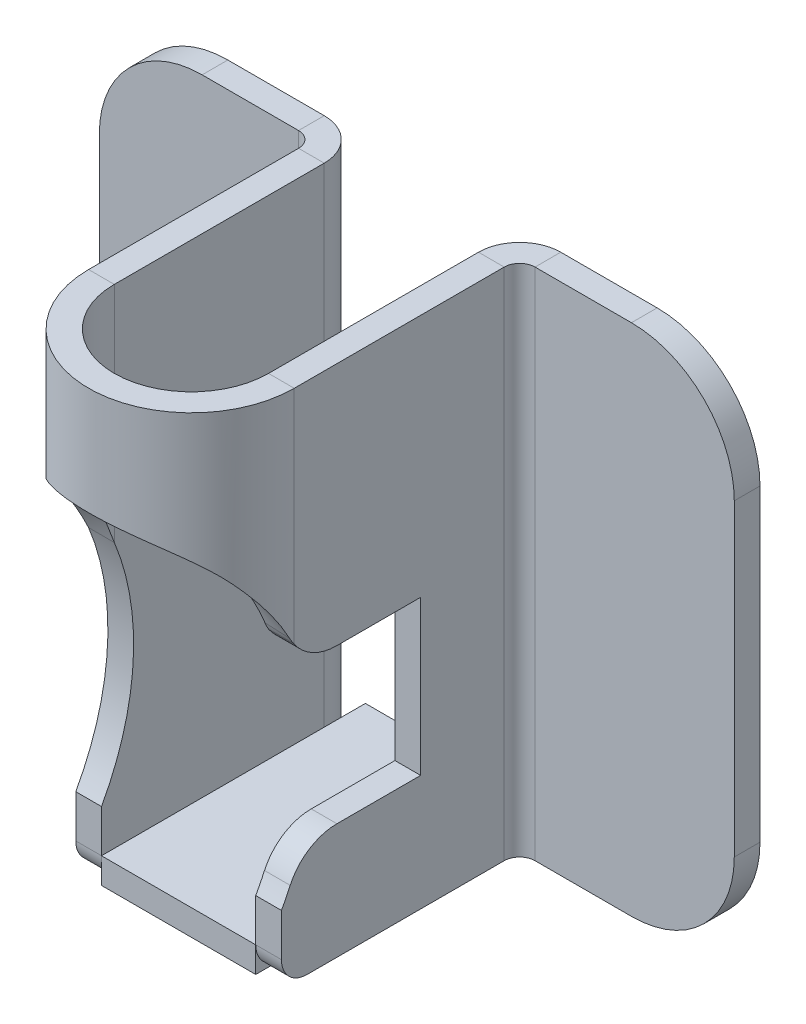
ISO-10303-21;
HEADER;
FILE_DESCRIPTION(('STEP AP214'),'2;1');
FILE_NAME('part.step','',(''),(''),'','','');
FILE_SCHEMA(('AUTOMOTIVE_DESIGN { 1 0 10303 214 1 1 1 1 }'));
ENDSEC;
DATA;
#1=APPLICATION_CONTEXT('core data for automotive mechanical design processes');
#2=APPLICATION_PROTOCOL_DEFINITION('international standard','automotive_design',2000,#1);
#3=PRODUCT_CONTEXT('',#1,'mechanical');
#4=PRODUCT('Part','Part','',(#3));
#5=PRODUCT_RELATED_PRODUCT_CATEGORY('part','',(#4));
#6=PRODUCT_DEFINITION_FORMATION('','',#4);
#7=PRODUCT_DEFINITION_CONTEXT('part definition',#1,'design');
#8=PRODUCT_DEFINITION('design','',#6,#7);
#9=PRODUCT_DEFINITION_SHAPE('','',#8);
#10=(LENGTH_UNIT() NAMED_UNIT(*) SI_UNIT(.MILLI.,.METRE.));
#11=(NAMED_UNIT(*) PLANE_ANGLE_UNIT() SI_UNIT($,.RADIAN.));
#12=(NAMED_UNIT(*) SI_UNIT($,.STERADIAN.) SOLID_ANGLE_UNIT());
#13=UNCERTAINTY_MEASURE_WITH_UNIT(LENGTH_MEASURE(1.E-05),#10,'distance_accuracy_value','');
#14=(GEOMETRIC_REPRESENTATION_CONTEXT(3) GLOBAL_UNCERTAINTY_ASSIGNED_CONTEXT((#13)) GLOBAL_UNIT_ASSIGNED_CONTEXT((#10,
#11,#12)) REPRESENTATION_CONTEXT('',''));
#15=CARTESIAN_POINT('',(0.,0.,0.));
#16=DIRECTION('',(0.,0.,1.));
#17=DIRECTION('',(1.,0.,0.));
#18=AXIS2_PLACEMENT_3D('',#15,#16,#17);
#19=CARTESIAN_POINT('',(117.92,32.,2.));
#20=DIRECTION('',(0.,0.,1.));
#21=DIRECTION('',(1.,0.,0.));
#22=AXIS2_PLACEMENT_3D('',#19,#20,#21);
#23=PLANE('',#22);
#24=DIRECTION('',(1.,0.,0.));
#25=VECTOR('',#24,1.);
#26=CARTESIAN_POINT('',(46.2600000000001,0.,2.00000000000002));
#27=LINE('',#26,#25);
#28=CARTESIAN_POINT('',(46.2600000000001,0.,2.00000000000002));
#29=VERTEX_POINT('',#28);
#30=CARTESIAN_POINT('',(53.7600000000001,0.,2.00000000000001));
#31=VERTEX_POINT('',#30);
#32=EDGE_CURVE('E791',#29,#31,#27,.T.);
#33=ORIENTED_EDGE('',*,*,#32,.T.);
#34=DIRECTION('',(0.,1.,0.));
#35=VECTOR('',#34,1.);
#36=CARTESIAN_POINT('',(53.7600000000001,32.,1.99999999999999));
#37=LINE('',#36,#35);
#38=CARTESIAN_POINT('',(53.7600000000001,40.,1.99999999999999));
#39=VERTEX_POINT('',#38);
#40=EDGE_CURVE('E806',#31,#39,#37,.T.);
#41=ORIENTED_EDGE('',*,*,#40,.T.);
#42=DIRECTION('',(-1.,0.,0.));
#43=VECTOR('',#42,1.);
#44=CARTESIAN_POINT('',(46.2600000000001,40.,2.));
#45=LINE('',#44,#43);
#46=CARTESIAN_POINT('',(46.2600000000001,40.,2.));
#47=VERTEX_POINT('',#46);
#48=EDGE_CURVE('E783',#39,#47,#45,.T.);
#49=ORIENTED_EDGE('',*,*,#48,.T.);
#50=CARTESIAN_POINT('',(46.2600000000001,32.,2.));
#51=DIRECTION('',(0.,0.,1.));
#52=DIRECTION('',(1.,0.,0.));
#53=AXIS2_PLACEMENT_3D('',#50,#51,#52);
#54=CIRCLE('',#53,8.);
#55=CARTESIAN_POINT('',(38.2600000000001,32.,2.));
#56=VERTEX_POINT('',#55);
#57=EDGE_CURVE('E785',#47,#56,#54,.T.);
#58=ORIENTED_EDGE('',*,*,#57,.T.);
#59=DIRECTION('',(0.,-1.,0.));
#60=VECTOR('',#59,1.);
#61=CARTESIAN_POINT('',(38.2600000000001,32.,2.));
#62=LINE('',#61,#60);
#63=CARTESIAN_POINT('',(38.2600000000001,8.,2.00000000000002));
#64=VERTEX_POINT('',#63);
#65=EDGE_CURVE('E787',#56,#64,#62,.T.);
#66=ORIENTED_EDGE('',*,*,#65,.T.);
#67=CARTESIAN_POINT('',(46.2600000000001,8.,2.00000000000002));
#68=DIRECTION('',(0.,0.,1.));
#69=DIRECTION('',(1.,0.,0.));
#70=AXIS2_PLACEMENT_3D('',#67,#68,#69);
#71=CIRCLE('',#70,8.);
#72=EDGE_CURVE('E789',#64,#29,#71,.T.);
#73=ORIENTED_EDGE('',*,*,#72,.T.);
#74=EDGE_LOOP('',(#33,#41,#49,#58,#66,#73));
#75=FACE_BOUND('',#74,.T.);
#76=ADVANCED_FACE('F32',(#75),#23,.T.);
#77=CARTESIAN_POINT('',(46.2600000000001,40.,2.));
#78=DIRECTION('',(0.,-1.,0.));
#79=DIRECTION('',(1.,0.,0.));
#80=AXIS2_PLACEMENT_3D('',#77,#78,#79);
#81=PLANE('',#80);
#82=DIRECTION('',(0.,0.,1.));
#83=VECTOR('',#82,1.);
#84=CARTESIAN_POINT('',(53.7600000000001,40.,1.99999999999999));
#85=LINE('',#84,#83);
#86=CARTESIAN_POINT('',(53.7600000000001,40.,0.));
#87=VERTEX_POINT('',#86);
#88=EDGE_CURVE('E809',#87,#39,#85,.T.);
#89=ORIENTED_EDGE('',*,*,#88,.F.);
#90=DIRECTION('',(-1.,0.,0.));
#91=VECTOR('',#90,1.);
#92=CARTESIAN_POINT('',(46.2600000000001,40.,0.));
#93=LINE('',#92,#91);
#94=CARTESIAN_POINT('',(46.2600000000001,40.,0.));
#95=VERTEX_POINT('',#94);
#96=EDGE_CURVE('E726',#87,#95,#93,.T.);
#97=ORIENTED_EDGE('',*,*,#96,.T.);
#98=DIRECTION('',(0.,0.,-1.));
#99=VECTOR('',#98,1.);
#100=CARTESIAN_POINT('',(46.2600000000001,40.,2.));
#101=LINE('',#100,#99);
#102=EDGE_CURVE('E803',#47,#95,#101,.T.);
#103=ORIENTED_EDGE('',*,*,#102,.F.);
#104=ORIENTED_EDGE('',*,*,#48,.F.);
#105=EDGE_LOOP('',(#89,#97,#103,#104));
#106=FACE_BOUND('',#105,.T.);
#107=ADVANCED_FACE('F34',(#106),#81,.F.);
#108=CARTESIAN_POINT('',(46.2600000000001,32.,2.));
#109=DIRECTION('',(0.,0.,-1.));
#110=DIRECTION('',(-1.,0.,0.));
#111=AXIS2_PLACEMENT_3D('',#108,#109,#110);
#112=CYLINDRICAL_SURFACE('',#111,8.);
#113=CARTESIAN_POINT('',(46.2600000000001,32.,0.));
#114=DIRECTION('',(0.,0.,1.));
#115=DIRECTION('',(1.,0.,0.));
#116=AXIS2_PLACEMENT_3D('',#113,#114,#115);
#117=CIRCLE('',#116,8.);
#118=CARTESIAN_POINT('',(38.2600000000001,32.,0.));
#119=VERTEX_POINT('',#118);
#120=EDGE_CURVE('E775',#95,#119,#117,.T.);
#121=ORIENTED_EDGE('',*,*,#120,.T.);
#122=DIRECTION('',(0.,0.,-1.));
#123=VECTOR('',#122,1.);
#124=CARTESIAN_POINT('',(38.2600000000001,32.,2.));
#125=LINE('',#124,#123);
#126=EDGE_CURVE('E800',#56,#119,#125,.T.);
#127=ORIENTED_EDGE('',*,*,#126,.F.);
#128=ORIENTED_EDGE('',*,*,#57,.F.);
#129=ORIENTED_EDGE('',*,*,#102,.T.);
#130=EDGE_LOOP('',(#121,#127,#128,#129));
#131=FACE_BOUND('',#130,.T.);
#132=ADVANCED_FACE('F901',(#131),#112,.T.);
#133=CARTESIAN_POINT('',(38.2600000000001,32.,2.));
#134=DIRECTION('',(1.,0.,0.));
#135=DIRECTION('',(0.,1.,0.));
#136=AXIS2_PLACEMENT_3D('',#133,#134,#135);
#137=PLANE('',#136);
#138=DIRECTION('',(0.,-1.,0.));
#139=VECTOR('',#138,1.);
#140=CARTESIAN_POINT('',(38.2600000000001,32.,0.));
#141=LINE('',#140,#139);
#142=CARTESIAN_POINT('',(38.2600000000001,8.,0.));
#143=VERTEX_POINT('',#142);
#144=EDGE_CURVE('E777',#119,#143,#141,.T.);
#145=ORIENTED_EDGE('',*,*,#144,.T.);
#146=DIRECTION('',(0.,0.,-1.));
#147=VECTOR('',#146,1.);
#148=CARTESIAN_POINT('',(38.2600000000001,8.,2.00000000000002));
#149=LINE('',#148,#147);
#150=EDGE_CURVE('E797',#64,#143,#149,.T.);
#151=ORIENTED_EDGE('',*,*,#150,.F.);
#152=ORIENTED_EDGE('',*,*,#65,.F.);
#153=ORIENTED_EDGE('',*,*,#126,.T.);
#154=EDGE_LOOP('',(#145,#151,#152,#153));
#155=FACE_BOUND('',#154,.T.);
#156=ADVANCED_FACE('F912',(#155),#137,.F.);
#157=CARTESIAN_POINT('',(46.2600000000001,8.,2.00000000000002));
#158=DIRECTION('',(0.,0.,-1.));
#159=DIRECTION('',(-1.,0.,0.));
#160=AXIS2_PLACEMENT_3D('',#157,#158,#159);
#161=CYLINDRICAL_SURFACE('',#160,8.);
#162=CARTESIAN_POINT('',(46.2600000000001,8.,0.));
#163=DIRECTION('',(0.,0.,1.));
#164=DIRECTION('',(1.,0.,0.));
#165=AXIS2_PLACEMENT_3D('',#162,#163,#164);
#166=CIRCLE('',#165,8.);
#167=CARTESIAN_POINT('',(46.2600000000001,0.,0.));
#168=VERTEX_POINT('',#167);
#169=EDGE_CURVE('E779',#143,#168,#166,.T.);
#170=ORIENTED_EDGE('',*,*,#169,.T.);
#171=DIRECTION('',(0.,0.,-1.));
#172=VECTOR('',#171,1.);
#173=CARTESIAN_POINT('',(46.2600000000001,0.,2.00000000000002));
#174=LINE('',#173,#172);
#175=EDGE_CURVE('E794',#29,#168,#174,.T.);
#176=ORIENTED_EDGE('',*,*,#175,.F.);
#177=ORIENTED_EDGE('',*,*,#72,.F.);
#178=ORIENTED_EDGE('',*,*,#150,.T.);
#179=EDGE_LOOP('',(#170,#176,#177,#178));
#180=FACE_BOUND('',#179,.T.);
#181=ADVANCED_FACE('F909',(#180),#161,.T.);
#182=CARTESIAN_POINT('',(46.2600000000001,0.,2.00000000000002));
#183=DIRECTION('',(0.,1.,0.));
#184=DIRECTION('',(0.,0.,1.));
#185=AXIS2_PLACEMENT_3D('',#182,#183,#184);
#186=PLANE('',#185);
#187=DIRECTION('',(0.,0.,-1.));
#188=VECTOR('',#187,1.);
#189=CARTESIAN_POINT('',(53.7600000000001,0.,2.00000000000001));
#190=LINE('',#189,#188);
#191=CARTESIAN_POINT('',(53.7600000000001,0.,0.));
#192=VERTEX_POINT('',#191);
#193=EDGE_CURVE('E41',#31,#192,#190,.T.);
#194=ORIENTED_EDGE('',*,*,#193,.F.);
#195=ORIENTED_EDGE('',*,*,#32,.F.);
#196=ORIENTED_EDGE('',*,*,#175,.T.);
#197=DIRECTION('',(1.,0.,0.));
#198=VECTOR('',#197,1.);
#199=CARTESIAN_POINT('',(46.2600000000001,0.,0.));
#200=LINE('',#199,#198);
#201=EDGE_CURVE('E781',#168,#192,#200,.T.);
#202=ORIENTED_EDGE('',*,*,#201,.T.);
#203=EDGE_LOOP('',(#194,#195,#196,#202));
#204=FACE_BOUND('',#203,.T.);
#205=ADVANCED_FACE('F906',(#204),#186,.F.);
#206=CARTESIAN_POINT('',(117.92,32.,0.));
#207=DIRECTION('',(0.,0.,1.));
#208=DIRECTION('',(1.,0.,0.));
#209=AXIS2_PLACEMENT_3D('',#206,#207,#208);
#210=PLANE('',#209);
#211=DIRECTION('',(0.,1.,0.));
#212=VECTOR('',#211,1.);
#213=CARTESIAN_POINT('',(53.7600000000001,32.,0.));
#214=LINE('',#213,#212);
#215=EDGE_CURVE('E11',#192,#87,#214,.T.);
#216=ORIENTED_EDGE('',*,*,#215,.F.);
#217=ORIENTED_EDGE('',*,*,#201,.F.);
#218=ORIENTED_EDGE('',*,*,#169,.F.);
#219=ORIENTED_EDGE('',*,*,#144,.F.);
#220=ORIENTED_EDGE('',*,*,#120,.F.);
#221=ORIENTED_EDGE('',*,*,#96,.F.);
#222=EDGE_LOOP('',(#216,#217,#218,#219,#220,#221));
#223=FACE_BOUND('',#222,.T.);
#224=ADVANCED_FACE('F698',(#223),#210,.F.);
#225=CARTESIAN_POINT('',(54.9599999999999,32.,66.36));
#226=DIRECTION('',(-1.,0.,0.));
#227=DIRECTION('',(0.,0.,1.));
#228=AXIS2_PLACEMENT_3D('',#225,#226,#227);
#229=PLANE('',#228);
#230=CARTESIAN_POINT('',(54.96,15.,38.03));
#231=DIRECTION('',(1.,0.,0.));
#232=DIRECTION('',(0.,0.,1.));
#233=AXIS2_PLACEMENT_3D('',#230,#231,#232);
#234=CIRCLE('',#233,20.);
#235=CARTESIAN_POINT('',(54.9600000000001,5.31754163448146,20.53));
#236=VERTEX_POINT('',#235);
#237=CARTESIAN_POINT('',(54.9600000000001,22.6101072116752,19.5344257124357));
#238=VERTEX_POINT('',#237);
#239=EDGE_CURVE('E712',#236,#238,#234,.T.);
#240=ORIENTED_EDGE('',*,*,#239,.T.);
#241=DIRECTION('',(0.,1.,0.));
#242=VECTOR('',#241,1.);
#243=CARTESIAN_POINT('',(54.9600000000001,32.,19.5344257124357));
#244=LINE('',#243,#242);
#245=CARTESIAN_POINT('',(54.9600000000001,40.,19.5344257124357));
#246=VERTEX_POINT('',#245);
#247=EDGE_CURVE('E722',#238,#246,#244,.T.);
#248=ORIENTED_EDGE('',*,*,#247,.T.);
#249=DIRECTION('',(0.,0.,-1.));
#250=VECTOR('',#249,1.);
#251=CARTESIAN_POINT('',(54.9600000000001,40.,-5.30000000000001));
#252=LINE('',#251,#250);
#253=CARTESIAN_POINT('',(54.9600000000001,40.,3.2));
#254=VERTEX_POINT('',#253);
#255=EDGE_CURVE('E739',#246,#254,#252,.T.);
#256=ORIENTED_EDGE('',*,*,#255,.T.);
#257=DIRECTION('',(0.,1.,0.));
#258=VECTOR('',#257,1.);
#259=CARTESIAN_POINT('',(54.9600000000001,32.,3.19999999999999));
#260=LINE('',#259,#258);
#261=CARTESIAN_POINT('',(54.9600000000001,0.,3.19999999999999));
#262=VERTEX_POINT('',#261);
#263=EDGE_CURVE('E731',#262,#254,#260,.T.);
#264=ORIENTED_EDGE('',*,*,#263,.F.);
#265=DIRECTION('',(0.,0.,1.));
#266=VECTOR('',#265,1.);
#267=CARTESIAN_POINT('',(54.9600000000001,0.,-5.30000000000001));
#268=LINE('',#267,#266);
#269=CARTESIAN_POINT('',(54.9600000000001,0.,18.53));
#270=VERTEX_POINT('',#269);
#271=EDGE_CURVE('E744',#262,#270,#268,.T.);
#272=ORIENTED_EDGE('',*,*,#271,.T.);
#273=CARTESIAN_POINT('',(54.9600000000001,2.,18.53));
#274=DIRECTION('',(-1.,0.,0.));
#275=DIRECTION('',(0.,0.,-1.));
#276=AXIS2_PLACEMENT_3D('',#273,#274,#275);
#277=CIRCLE('',#276,2.);
#278=CARTESIAN_POINT('',(54.9600000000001,2.00000000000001,20.53));
#279=VERTEX_POINT('',#278);
#280=EDGE_CURVE('E757',#270,#279,#277,.T.);
#281=ORIENTED_EDGE('',*,*,#280,.T.);
#282=DIRECTION('',(0.,1.,0.));
#283=VECTOR('',#282,1.);
#284=CARTESIAN_POINT('',(54.9600000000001,5.31754163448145,20.53));
#285=LINE('',#284,#283);
#286=EDGE_CURVE('E720',#279,#236,#285,.T.);
#287=ORIENTED_EDGE('',*,*,#286,.T.);
#288=EDGE_LOOP('',(#240,#248,#256,#264,#272,#281,#287));
#289=FACE_BOUND('',#288,.T.);
#290=ADVANCED_FACE('F694',(#289),#229,.T.);
#291=CARTESIAN_POINT('',(54.9600000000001,40.,-5.30000000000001));
#292=DIRECTION('',(0.,-1.,0.));
#293=DIRECTION('',(0.,0.,1.));
#294=AXIS2_PLACEMENT_3D('',#291,#292,#293);
#295=PLANE('',#294);
#296=DIRECTION('',(-1.,0.,0.));
#297=VECTOR('',#296,1.);
#298=CARTESIAN_POINT('',(54.9600000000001,40.,19.5344257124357));
#299=LINE('',#298,#297);
#300=CARTESIAN_POINT('',(56.9600000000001,40.,19.5344257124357));
#301=VERTEX_POINT('',#300);
#302=EDGE_CURVE('E727',#301,#246,#299,.T.);
#303=ORIENTED_EDGE('',*,*,#302,.F.);
#304=DIRECTION('',(0.,0.,-1.));
#305=VECTOR('',#304,1.);
#306=CARTESIAN_POINT('',(56.9600000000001,40.,-5.30000000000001));
#307=LINE('',#306,#305);
#308=CARTESIAN_POINT('',(56.9600000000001,40.,3.20000000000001));
#309=VERTEX_POINT('',#308);
#310=EDGE_CURVE('E752',#301,#309,#307,.T.);
#311=ORIENTED_EDGE('',*,*,#310,.T.);
#312=DIRECTION('',(-1.,0.,0.));
#313=VECTOR('',#312,1.);
#314=CARTESIAN_POINT('',(54.9600000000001,40.,3.19999999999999));
#315=LINE('',#314,#313);
#316=EDGE_CURVE('E769',#309,#254,#315,.T.);
#317=ORIENTED_EDGE('',*,*,#316,.T.);
#318=ORIENTED_EDGE('',*,*,#255,.F.);
#319=EDGE_LOOP('',(#303,#311,#317,#318));
#320=FACE_BOUND('',#319,.T.);
#321=ADVANCED_FACE('F697',(#320),#295,.F.);
#322=CARTESIAN_POINT('',(54.9600000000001,0.,-5.30000000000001));
#323=DIRECTION('',(0.,1.,0.));
#324=DIRECTION('',(-1.,0.,0.));
#325=AXIS2_PLACEMENT_3D('',#322,#323,#324);
#326=PLANE('',#325);
#327=ORIENTED_EDGE('',*,*,#271,.F.);
#328=DIRECTION('',(1.,0.,0.));
#329=VECTOR('',#328,1.);
#330=CARTESIAN_POINT('',(54.9600000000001,0.,3.2));
#331=LINE('',#330,#329);
#332=CARTESIAN_POINT('',(56.9600000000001,0.,3.20000000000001));
#333=VERTEX_POINT('',#332);
#334=EDGE_CURVE('E289',#262,#333,#331,.T.);
#335=ORIENTED_EDGE('',*,*,#334,.T.);
#336=DIRECTION('',(0.,0.,-1.));
#337=VECTOR('',#336,1.);
#338=CARTESIAN_POINT('',(56.9600000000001,0.,32.6955250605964));
#339=LINE('',#338,#337);
#340=CARTESIAN_POINT('',(56.9600000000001,0.,0.));
#341=VERTEX_POINT('',#340);
#342=EDGE_CURVE('E281',#333,#341,#339,.T.);
#343=ORIENTED_EDGE('',*,*,#342,.T.);
#344=DIRECTION('',(-1.,0.,0.));
#345=VECTOR('',#344,1.);
#346=CARTESIAN_POINT('',(56.9600000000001,0.,0.));
#347=LINE('',#346,#345);
#348=CARTESIAN_POINT('',(68.96,0.,0.));
#349=VERTEX_POINT('',#348);
#350=EDGE_CURVE('E287',#349,#341,#347,.T.);
#351=ORIENTED_EDGE('',*,*,#350,.F.);
#352=DIRECTION('',(0.,0.,-1.));
#353=VECTOR('',#352,1.);
#354=CARTESIAN_POINT('',(68.96,0.,32.6955250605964));
#355=LINE('',#354,#353);
#356=CARTESIAN_POINT('',(68.96,0.,3.2));
#357=VERTEX_POINT('',#356);
#358=EDGE_CURVE('E317',#357,#349,#355,.T.);
#359=ORIENTED_EDGE('',*,*,#358,.F.);
#360=DIRECTION('',(-1.,0.,0.));
#361=VECTOR('',#360,1.);
#362=CARTESIAN_POINT('',(70.96,0.,3.20000000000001));
#363=LINE('',#362,#361);
#364=CARTESIAN_POINT('',(70.96,0.,3.20000000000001));
#365=VERTEX_POINT('',#364);
#366=EDGE_CURVE('E622',#365,#357,#363,.T.);
#367=ORIENTED_EDGE('',*,*,#366,.F.);
#368=DIRECTION('',(0.,0.,-1.));
#369=VECTOR('',#368,1.);
#370=CARTESIAN_POINT('',(70.9600000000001,0.,18.53));
#371=LINE('',#370,#369);
#372=CARTESIAN_POINT('',(70.9600000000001,0.,18.53));
#373=VERTEX_POINT('',#372);
#374=EDGE_CURVE('E592',#373,#365,#371,.T.);
#375=ORIENTED_EDGE('',*,*,#374,.F.);
#376=DIRECTION('',(-1.,0.,0.));
#377=VECTOR('',#376,1.);
#378=CARTESIAN_POINT('',(70.9600000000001,0.,18.53));
#379=LINE('',#378,#377);
#380=CARTESIAN_POINT('',(68.96,0.,18.53));
#381=VERTEX_POINT('',#380);
#382=EDGE_CURVE('E595',#373,#381,#379,.T.);
#383=ORIENTED_EDGE('',*,*,#382,.T.);
#384=CARTESIAN_POINT('',(68.96,0.,20.53));
#385=VERTEX_POINT('',#384);
#386=EDGE_CURVE('E314',#385,#381,#355,.T.);
#387=ORIENTED_EDGE('',*,*,#386,.F.);
#388=DIRECTION('',(1.,0.,0.));
#389=VECTOR('',#388,1.);
#390=CARTESIAN_POINT('',(56.9600000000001,0.,20.53));
#391=LINE('',#390,#389);
#392=CARTESIAN_POINT('',(56.9600000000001,0.,20.53));
#393=VERTEX_POINT('',#392);
#394=EDGE_CURVE('E309',#393,#385,#391,.T.);
#395=ORIENTED_EDGE('',*,*,#394,.F.);
#396=CARTESIAN_POINT('',(56.9600000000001,0.,18.53));
#397=VERTEX_POINT('',#396);
#398=EDGE_CURVE('E292',#393,#397,#339,.T.);
#399=ORIENTED_EDGE('',*,*,#398,.T.);
#400=DIRECTION('',(1.,0.,0.));
#401=VECTOR('',#400,1.);
#402=CARTESIAN_POINT('',(54.9600000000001,0.,18.53));
#403=LINE('',#402,#401);
#404=EDGE_CURVE('E763',#270,#397,#403,.T.);
#405=ORIENTED_EDGE('',*,*,#404,.F.);
#406=EDGE_LOOP('',(#327,#335,#343,#351,#359,#367,#375,#383,#387,#395,#399,#405));
#407=FACE_BOUND('',#406,.T.);
#408=ADVANCED_FACE('F284',(#407),#326,.F.);
#409=CARTESIAN_POINT('',(56.9599999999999,32.,66.36));
#410=DIRECTION('',(-1.,0.,0.));
#411=DIRECTION('',(0.,0.,1.));
#412=AXIS2_PLACEMENT_3D('',#409,#410,#411);
#413=PLANE('',#412);
#414=DIRECTION('',(0.,1.,0.));
#415=VECTOR('',#414,1.);
#416=CARTESIAN_POINT('',(56.9600000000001,5.31754163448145,20.53));
#417=LINE('',#416,#415);
#418=CARTESIAN_POINT('',(56.9600000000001,2.00000000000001,20.53));
#419=VERTEX_POINT('',#418);
#420=CARTESIAN_POINT('',(56.9600000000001,5.31754163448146,20.53));
#421=VERTEX_POINT('',#420);
#422=EDGE_CURVE('E740',#419,#421,#417,.T.);
#423=ORIENTED_EDGE('',*,*,#422,.F.);
#424=DIRECTION('',(0.,0.,-1.));
#425=VECTOR('',#424,1.);
#426=CARTESIAN_POINT('',(56.9600000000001,2.,32.6955250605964));
#427=LINE('',#426,#425);
#428=CARTESIAN_POINT('',(56.9600000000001,2.,3.19999999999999));
#429=VERTEX_POINT('',#428);
#430=EDGE_CURVE('E320',#419,#429,#427,.T.);
#431=ORIENTED_EDGE('',*,*,#430,.T.);
#432=DIRECTION('',(0.,1.,0.));
#433=VECTOR('',#432,1.);
#434=CARTESIAN_POINT('',(56.9600000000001,32.,3.2));
#435=LINE('',#434,#433);
#436=EDGE_CURVE('E765',#429,#309,#435,.T.);
#437=ORIENTED_EDGE('',*,*,#436,.T.);
#438=ORIENTED_EDGE('',*,*,#310,.F.);
#439=DIRECTION('',(0.,1.,0.));
#440=VECTOR('',#439,1.);
#441=CARTESIAN_POINT('',(56.9600000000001,32.,19.5344257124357));
#442=LINE('',#441,#440);
#443=CARTESIAN_POINT('',(56.9600000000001,22.6101072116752,19.5344257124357));
#444=VERTEX_POINT('',#443);
#445=EDGE_CURVE('E723',#444,#301,#442,.T.);
#446=ORIENTED_EDGE('',*,*,#445,.F.);
#447=CARTESIAN_POINT('',(56.96,15.,38.03));
#448=DIRECTION('',(1.,0.,0.));
#449=DIRECTION('',(0.,0.,1.));
#450=AXIS2_PLACEMENT_3D('',#447,#448,#449);
#451=CIRCLE('',#450,20.);
#452=EDGE_CURVE('E737',#421,#444,#451,.T.);
#453=ORIENTED_EDGE('',*,*,#452,.F.);
#454=EDGE_LOOP('',(#423,#431,#437,#438,#446,#453));
#455=FACE_BOUND('',#454,.T.);
#456=ADVANCED_FACE('F689',(#455),#413,.F.);
#457=CARTESIAN_POINT('',(54.9600000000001,2.,18.53));
#458=DIRECTION('',(1.,0.,0.));
#459=DIRECTION('',(0.,0.,-1.));
#460=AXIS2_PLACEMENT_3D('',#457,#458,#459);
#461=CYLINDRICAL_SURFACE('',#460,2.);
#462=CARTESIAN_POINT('',(56.9600000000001,2.,18.53));
#463=DIRECTION('',(-1.,0.,0.));
#464=DIRECTION('',(0.,0.,-1.));
#465=AXIS2_PLACEMENT_3D('',#462,#463,#464);
#466=CIRCLE('',#465,2.);
#467=EDGE_CURVE('E746',#397,#419,#466,.T.);
#468=ORIENTED_EDGE('',*,*,#467,.T.);
#469=DIRECTION('',(1.,0.,0.));
#470=VECTOR('',#469,1.);
#471=CARTESIAN_POINT('',(54.9600000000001,2.00000000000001,20.53));
#472=LINE('',#471,#470);
#473=EDGE_CURVE('E761',#279,#419,#472,.T.);
#474=ORIENTED_EDGE('',*,*,#473,.F.);
#475=ORIENTED_EDGE('',*,*,#280,.F.);
#476=ORIENTED_EDGE('',*,*,#404,.T.);
#477=EDGE_LOOP('',(#468,#474,#475,#476));
#478=FACE_BOUND('',#477,.T.);
#479=ADVANCED_FACE('F692',(#478),#461,.T.);
#480=CARTESIAN_POINT('',(54.9600000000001,5.31754163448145,20.53));
#481=DIRECTION('',(0.,0.,-1.));
#482=DIRECTION('',(-1.,0.,0.));
#483=AXIS2_PLACEMENT_3D('',#480,#481,#482);
#484=PLANE('',#483);
#485=ORIENTED_EDGE('',*,*,#422,.T.);
#486=DIRECTION('',(1.,0.,0.));
#487=VECTOR('',#486,1.);
#488=CARTESIAN_POINT('',(54.9600000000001,5.31754163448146,20.53));
#489=LINE('',#488,#487);
#490=EDGE_CURVE('E719',#236,#421,#489,.T.);
#491=ORIENTED_EDGE('',*,*,#490,.F.);
#492=ORIENTED_EDGE('',*,*,#286,.F.);
#493=ORIENTED_EDGE('',*,*,#473,.T.);
#494=EDGE_LOOP('',(#485,#491,#492,#493));
#495=FACE_BOUND('',#494,.T.);
#496=ADVANCED_FACE('F703',(#495),#484,.F.);
#497=CARTESIAN_POINT('',(54.96,15.,38.03));
#498=DIRECTION('',(1.,0.,0.));
#499=DIRECTION('',(0.,0.,-1.));
#500=AXIS2_PLACEMENT_3D('',#497,#498,#499);
#501=CYLINDRICAL_SURFACE('',#500,20.);
#502=CARTESIAN_POINT('',(54.9600000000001,22.6101072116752,19.5344257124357));
#503=CARTESIAN_POINT('',(56.9600000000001,22.6101072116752,19.5344257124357));
#504=B_SPLINE_CURVE_WITH_KNOTS('',1,(#502,#503),.UNSPECIFIED.,.F.,.F.,(2,2),(0.,1.),.UNSPECIFIED.);
#505=EDGE_CURVE('E487',#238,#444,#504,.T.);
#506=ORIENTED_EDGE('',*,*,#505,.F.);
#507=ORIENTED_EDGE('',*,*,#239,.F.);
#508=ORIENTED_EDGE('',*,*,#490,.T.);
#509=ORIENTED_EDGE('',*,*,#452,.T.);
#510=EDGE_LOOP('',(#506,#507,#508,#509));
#511=FACE_BOUND('',#510,.T.);
#512=ADVANCED_FACE('F687',(#511),#501,.F.);
#513=CARTESIAN_POINT('',(53.7600000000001,40.,3.19999999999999));
#514=DIRECTION('',(0.,-1.,0.));
#515=DIRECTION('',(-1.,0.,0.));
#516=AXIS2_PLACEMENT_3D('',#513,#514,#515);
#517=PLANE('',#516);
#518=ORIENTED_EDGE('',*,*,#88,.T.);
#519=CARTESIAN_POINT('',(53.7600000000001,40.,3.19999999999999));
#520=DIRECTION('',(0.,-1.,0.));
#521=DIRECTION('',(0.,0.,1.));
#522=AXIS2_PLACEMENT_3D('',#519,#520,#521);
#523=CIRCLE('',#522,1.19999999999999);
#524=EDGE_CURVE('E823',#254,#39,#523,.F.);
#525=ORIENTED_EDGE('',*,*,#524,.F.);
#526=ORIENTED_EDGE('',*,*,#316,.F.);
#527=CARTESIAN_POINT('',(53.7600000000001,40.,3.19999999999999));
#528=DIRECTION('',(0.,-1.,0.));
#529=DIRECTION('',(0.,0.,1.));
#530=AXIS2_PLACEMENT_3D('',#527,#528,#529);
#531=CIRCLE('',#530,3.19999999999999);
#532=EDGE_CURVE('E822',#309,#87,#531,.F.);
#533=ORIENTED_EDGE('',*,*,#532,.T.);
#534=EDGE_LOOP('',(#518,#525,#526,#533));
#535=FACE_BOUND('',#534,.T.);
#536=ADVANCED_FACE('F683',(#535),#517,.F.);
#537=CARTESIAN_POINT('',(53.7600000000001,0.,3.19999999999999));
#538=DIRECTION('',(0.,1.,0.));
#539=DIRECTION('',(1.,0.,0.));
#540=AXIS2_PLACEMENT_3D('',#537,#538,#539);
#541=PLANE('',#540);
#542=ORIENTED_EDGE('',*,*,#334,.F.);
#543=CARTESIAN_POINT('',(53.7600000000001,0.,3.19999999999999));
#544=DIRECTION('',(0.,-1.,0.));
#545=DIRECTION('',(0.,0.,1.));
#546=AXIS2_PLACEMENT_3D('',#543,#544,#545);
#547=CIRCLE('',#546,1.19999999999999);
#548=EDGE_CURVE('E817',#31,#262,#547,.T.);
#549=ORIENTED_EDGE('',*,*,#548,.F.);
#550=ORIENTED_EDGE('',*,*,#193,.T.);
#551=CARTESIAN_POINT('',(53.7600000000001,0.,3.19999999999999));
#552=DIRECTION('',(0.,-1.,0.));
#553=DIRECTION('',(0.,0.,1.));
#554=AXIS2_PLACEMENT_3D('',#551,#552,#553);
#555=CIRCLE('',#554,3.19999999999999);
#556=EDGE_CURVE('E814',#192,#333,#555,.T.);
#557=ORIENTED_EDGE('',*,*,#556,.T.);
#558=EDGE_LOOP('',(#542,#549,#550,#557));
#559=FACE_BOUND('',#558,.T.);
#560=ADVANCED_FACE('F679',(#559),#541,.F.);
#561=CARTESIAN_POINT('',(53.7600000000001,126.4817876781,3.19999999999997));
#562=DIRECTION('',(0.,-1.,0.));
#563=DIRECTION('',(0.,0.,1.));
#564=AXIS2_PLACEMENT_3D('',#561,#562,#563);
#565=CYLINDRICAL_SURFACE('',#564,3.19999999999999);
#566=ORIENTED_EDGE('',*,*,#556,.F.);
#567=ORIENTED_EDGE('',*,*,#215,.T.);
#568=ORIENTED_EDGE('',*,*,#532,.F.);
#569=ORIENTED_EDGE('',*,*,#436,.F.);
#570=EDGE_CURVE('E766',#333,#429,#435,.T.);
#571=ORIENTED_EDGE('',*,*,#570,.F.);
#572=EDGE_LOOP('',(#566,#567,#568,#569,#571));
#573=FACE_BOUND('',#572,.T.);
#574=ADVANCED_FACE('F675',(#573),#565,.T.);
#575=CARTESIAN_POINT('',(53.7600000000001,126.4817876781,3.19999999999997));
#576=DIRECTION('',(0.,-1.,0.));
#577=DIRECTION('',(0.,0.,1.));
#578=AXIS2_PLACEMENT_3D('',#575,#576,#577);
#579=CYLINDRICAL_SURFACE('',#578,1.19999999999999);
#580=ORIENTED_EDGE('',*,*,#548,.T.);
#581=ORIENTED_EDGE('',*,*,#263,.T.);
#582=ORIENTED_EDGE('',*,*,#524,.T.);
#583=ORIENTED_EDGE('',*,*,#40,.F.);
#584=EDGE_LOOP('',(#580,#581,#582,#583));
#585=FACE_BOUND('',#584,.T.);
#586=ADVANCED_FACE('F666',(#585),#579,.F.);
#587=CARTESIAN_POINT('',(70.96,25.,16.2125757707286));
#588=DIRECTION('',(-1.,0.,0.));
#589=DIRECTION('',(0.,0.,1.));
#590=AXIS2_PLACEMENT_3D('',#587,#588,#589);
#591=CYLINDRICAL_SURFACE('',#590,4.);
#592=CARTESIAN_POINT('',(70.96,25.,16.2125757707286));
#593=DIRECTION('',(1.,0.,0.));
#594=DIRECTION('',(0.,0.,-1.));
#595=AXIS2_PLACEMENT_3D('',#592,#593,#594);
#596=CIRCLE('',#595,4.);
#597=CARTESIAN_POINT('',(70.96,22.7717017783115,19.5344257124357));
#598=VERTEX_POINT('',#597);
#599=CARTESIAN_POINT('',(70.96,21.,16.2125757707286));
#600=VERTEX_POINT('',#599);
#601=EDGE_CURVE('E577',#598,#600,#596,.T.);
#602=ORIENTED_EDGE('',*,*,#601,.F.);
#603=CARTESIAN_POINT('',(68.96,22.7717017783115,19.5344257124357));
#604=CARTESIAN_POINT('',(70.96,22.7717017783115,19.5344257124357));
#605=B_SPLINE_CURVE_WITH_KNOTS('',1,(#603,#604),.UNSPECIFIED.,.F.,.F.,(2,2),(0.,1.),.UNSPECIFIED.);
#606=CARTESIAN_POINT('',(68.96,22.7717017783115,19.5344257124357));
#607=VERTEX_POINT('',#606);
#608=EDGE_CURVE('E648',#598,#607,#605,.F.);
#609=ORIENTED_EDGE('',*,*,#608,.T.);
#610=CARTESIAN_POINT('',(68.96,25.,16.2125757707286));
#611=DIRECTION('',(1.,0.,0.));
#612=DIRECTION('',(0.,0.,-1.));
#613=AXIS2_PLACEMENT_3D('',#610,#611,#612);
#614=CIRCLE('',#613,4.);
#615=CARTESIAN_POINT('',(68.96,21.,16.2125757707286));
#616=VERTEX_POINT('',#615);
#617=EDGE_CURVE('E557',#607,#616,#614,.T.);
#618=ORIENTED_EDGE('',*,*,#617,.T.);
#619=DIRECTION('',(-1.,0.,0.));
#620=VECTOR('',#619,1.);
#621=CARTESIAN_POINT('',(70.96,21.,16.2125757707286));
#622=LINE('',#621,#620);
#623=EDGE_CURVE('E616',#600,#616,#622,.T.);
#624=ORIENTED_EDGE('',*,*,#623,.F.);
#625=EDGE_LOOP('',(#602,#609,#618,#624));
#626=FACE_BOUND('',#625,.T.);
#627=ADVANCED_FACE('F655',(#626),#591,.T.);
#628=CARTESIAN_POINT('',(70.9600000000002,40.,66.36));
#629=DIRECTION('',(0.,-1.,0.));
#630=DIRECTION('',(0.,0.,-1.));
#631=AXIS2_PLACEMENT_3D('',#628,#629,#630);
#632=PLANE('',#631);
#633=DIRECTION('',(0.,0.,1.));
#634=VECTOR('',#633,1.);
#635=CARTESIAN_POINT('',(68.9600000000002,40.,66.36));
#636=LINE('',#635,#634);
#637=CARTESIAN_POINT('',(68.96,40.,3.20000000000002));
#638=VERTEX_POINT('',#637);
#639=CARTESIAN_POINT('',(68.96,40.,19.5344257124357));
#640=VERTEX_POINT('',#639);
#641=EDGE_CURVE('E554',#638,#640,#636,.T.);
#642=ORIENTED_EDGE('',*,*,#641,.T.);
#643=DIRECTION('',(1.,0.,0.));
#644=VECTOR('',#643,1.);
#645=CARTESIAN_POINT('',(70.9600000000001,40.,19.5344257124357));
#646=LINE('',#645,#644);
#647=CARTESIAN_POINT('',(70.9600000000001,40.,19.5344257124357));
#648=VERTEX_POINT('',#647);
#649=EDGE_CURVE('E633',#640,#648,#646,.T.);
#650=ORIENTED_EDGE('',*,*,#649,.T.);
#651=DIRECTION('',(0.,0.,1.));
#652=VECTOR('',#651,1.);
#653=CARTESIAN_POINT('',(70.9600000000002,40.,66.36));
#654=LINE('',#653,#652);
#655=CARTESIAN_POINT('',(70.96,40.,3.20000000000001));
#656=VERTEX_POINT('',#655);
#657=EDGE_CURVE('E574',#656,#648,#654,.T.);
#658=ORIENTED_EDGE('',*,*,#657,.F.);
#659=DIRECTION('',(1.,0.,0.));
#660=VECTOR('',#659,1.);
#661=CARTESIAN_POINT('',(70.96,40.,3.20000000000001));
#662=LINE('',#661,#660);
#663=EDGE_CURVE('E619',#638,#656,#662,.T.);
#664=ORIENTED_EDGE('',*,*,#663,.F.);
#665=EDGE_LOOP('',(#642,#650,#658,#664));
#666=FACE_BOUND('',#665,.T.);
#667=ADVANCED_FACE('F665',(#666),#632,.F.);
#668=CARTESIAN_POINT('',(68.96,32.,-5.29999999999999));
#669=DIRECTION('',(1.,0.,0.));
#670=DIRECTION('',(0.,0.,-1.));
#671=AXIS2_PLACEMENT_3D('',#668,#669,#670);
#672=PLANE('',#671);
#673=DIRECTION('',(0.,1.,0.));
#674=VECTOR('',#673,1.);
#675=CARTESIAN_POINT('',(68.96,32.,3.20000000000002));
#676=LINE('',#675,#674);
#677=CARTESIAN_POINT('',(68.96,2.,3.20000000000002));
#678=VERTEX_POINT('',#677);
#679=EDGE_CURVE('E628',#678,#638,#676,.T.);
#680=ORIENTED_EDGE('',*,*,#679,.F.);
#681=DIRECTION('',(0.,0.,-1.));
#682=VECTOR('',#681,1.);
#683=CARTESIAN_POINT('',(68.96,2.,32.6955250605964));
#684=LINE('',#683,#682);
#685=CARTESIAN_POINT('',(68.96,2.,20.53));
#686=VERTEX_POINT('',#685);
#687=EDGE_CURVE('E49',#686,#678,#684,.T.);
#688=ORIENTED_EDGE('',*,*,#687,.F.);
#689=DIRECTION('',(0.,-1.,0.));
#690=VECTOR('',#689,1.);
#691=CARTESIAN_POINT('',(68.9600000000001,5.31754163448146,20.53));
#692=LINE('',#691,#690);
#693=CARTESIAN_POINT('',(68.9600000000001,5.31754163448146,20.53));
#694=VERTEX_POINT('',#693);
#695=EDGE_CURVE('E568',#694,#686,#692,.T.);
#696=ORIENTED_EDGE('',*,*,#695,.F.);
#697=CARTESIAN_POINT('',(68.9600000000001,15.,38.03));
#698=DIRECTION('',(-1.,0.,0.));
#699=DIRECTION('',(0.,0.,-1.));
#700=AXIS2_PLACEMENT_3D('',#697,#698,#699);
#701=CIRCLE('',#700,20.);
#702=CARTESIAN_POINT('',(68.9600000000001,6.66666666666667,19.8488131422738));
#703=VERTEX_POINT('',#702);
#704=EDGE_CURVE('E566',#703,#694,#701,.T.);
#705=ORIENTED_EDGE('',*,*,#704,.F.);
#706=CARTESIAN_POINT('',(68.96,5.,16.2125757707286));
#707=DIRECTION('',(1.,0.,0.));
#708=DIRECTION('',(0.,0.,-1.));
#709=AXIS2_PLACEMENT_3D('',#706,#707,#708);
#710=CIRCLE('',#709,4.);
#711=CARTESIAN_POINT('',(68.96,9.,16.2125757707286));
#712=VERTEX_POINT('',#711);
#713=EDGE_CURVE('E564',#712,#703,#710,.T.);
#714=ORIENTED_EDGE('',*,*,#713,.F.);
#715=DIRECTION('',(0.,0.,1.));
#716=VECTOR('',#715,1.);
#717=CARTESIAN_POINT('',(68.96,9.,9.70000000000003));
#718=LINE('',#717,#716);
#719=CARTESIAN_POINT('',(68.96,9.,9.70000000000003));
#720=VERTEX_POINT('',#719);
#721=EDGE_CURVE('E562',#720,#712,#718,.T.);
#722=ORIENTED_EDGE('',*,*,#721,.F.);
#723=DIRECTION('',(0.,-1.,0.));
#724=VECTOR('',#723,1.);
#725=CARTESIAN_POINT('',(68.96,21.,9.70000000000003));
#726=LINE('',#725,#724);
#727=CARTESIAN_POINT('',(68.96,21.,9.70000000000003));
#728=VERTEX_POINT('',#727);
#729=EDGE_CURVE('E560',#728,#720,#726,.T.);
#730=ORIENTED_EDGE('',*,*,#729,.F.);
#731=DIRECTION('',(0.,0.,-1.));
#732=VECTOR('',#731,1.);
#733=CARTESIAN_POINT('',(68.96,21.,16.2125757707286));
#734=LINE('',#733,#732);
#735=EDGE_CURVE('E558',#616,#728,#734,.T.);
#736=ORIENTED_EDGE('',*,*,#735,.F.);
#737=ORIENTED_EDGE('',*,*,#617,.F.);
#738=DIRECTION('',(0.,1.,0.));
#739=VECTOR('',#738,1.);
#740=CARTESIAN_POINT('',(68.9600000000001,32.,19.5344257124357));
#741=LINE('',#740,#739);
#742=EDGE_CURVE('E632',#607,#640,#741,.T.);
#743=ORIENTED_EDGE('',*,*,#742,.T.);
#744=ORIENTED_EDGE('',*,*,#641,.F.);
#745=EDGE_LOOP('',(#680,#688,#696,#705,#714,#722,#730,#736,#737,#743,#744));
#746=FACE_BOUND('',#745,.T.);
#747=ADVANCED_FACE('F671',(#746),#672,.F.);
#748=CARTESIAN_POINT('',(70.96,32.,-5.3));
#749=DIRECTION('',(1.,0.,0.));
#750=DIRECTION('',(0.,0.,-1.));
#751=AXIS2_PLACEMENT_3D('',#748,#749,#750);
#752=PLANE('',#751);
#753=CARTESIAN_POINT('',(70.96,5.,16.2125757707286));
#754=DIRECTION('',(1.,0.,0.));
#755=DIRECTION('',(0.,0.,-1.));
#756=AXIS2_PLACEMENT_3D('',#753,#754,#755);
#757=CIRCLE('',#756,4.);
#758=CARTESIAN_POINT('',(70.96,9.,16.2125757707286));
#759=VERTEX_POINT('',#758);
#760=CARTESIAN_POINT('',(70.9600000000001,6.66666666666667,19.8488131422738));
#761=VERTEX_POINT('',#760);
#762=EDGE_CURVE('E584',#759,#761,#757,.T.);
#763=ORIENTED_EDGE('',*,*,#762,.T.);
#764=CARTESIAN_POINT('',(70.9600000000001,15.,38.03));
#765=DIRECTION('',(-1.,0.,0.));
#766=DIRECTION('',(0.,0.,-1.));
#767=AXIS2_PLACEMENT_3D('',#764,#765,#766);
#768=CIRCLE('',#767,20.);
#769=CARTESIAN_POINT('',(70.9600000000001,5.31754163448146,20.53));
#770=VERTEX_POINT('',#769);
#771=EDGE_CURVE('E586',#761,#770,#768,.T.);
#772=ORIENTED_EDGE('',*,*,#771,.T.);
#773=DIRECTION('',(0.,-1.,0.));
#774=VECTOR('',#773,1.);
#775=CARTESIAN_POINT('',(70.9600000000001,5.31754163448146,20.53));
#776=LINE('',#775,#774);
#777=CARTESIAN_POINT('',(70.9600000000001,2.,20.53));
#778=VERTEX_POINT('',#777);
#779=EDGE_CURVE('E588',#770,#778,#776,.T.);
#780=ORIENTED_EDGE('',*,*,#779,.T.);
#781=CARTESIAN_POINT('',(70.9600000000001,2.,18.53));
#782=DIRECTION('',(1.,0.,0.));
#783=DIRECTION('',(0.,0.,1.));
#784=AXIS2_PLACEMENT_3D('',#781,#782,#783);
#785=CIRCLE('',#784,2.);
#786=EDGE_CURVE('E590',#778,#373,#785,.T.);
#787=ORIENTED_EDGE('',*,*,#786,.T.);
#788=ORIENTED_EDGE('',*,*,#374,.T.);
#789=DIRECTION('',(0.,1.,0.));
#790=VECTOR('',#789,1.);
#791=CARTESIAN_POINT('',(70.96,32.,3.20000000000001));
#792=LINE('',#791,#790);
#793=EDGE_CURVE('E625',#365,#656,#792,.T.);
#794=ORIENTED_EDGE('',*,*,#793,.T.);
#795=ORIENTED_EDGE('',*,*,#657,.T.);
#796=DIRECTION('',(0.,1.,0.));
#797=VECTOR('',#796,1.);
#798=CARTESIAN_POINT('',(70.9600000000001,32.,19.5344257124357));
#799=LINE('',#798,#797);
#800=EDGE_CURVE('E636',#598,#648,#799,.T.);
#801=ORIENTED_EDGE('',*,*,#800,.F.);
#802=ORIENTED_EDGE('',*,*,#601,.T.);
#803=DIRECTION('',(0.,0.,-1.));
#804=VECTOR('',#803,1.);
#805=CARTESIAN_POINT('',(70.96,21.,16.2125757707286));
#806=LINE('',#805,#804);
#807=CARTESIAN_POINT('',(70.96,21.,9.70000000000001));
#808=VERTEX_POINT('',#807);
#809=EDGE_CURVE('E578',#600,#808,#806,.T.);
#810=ORIENTED_EDGE('',*,*,#809,.T.);
#811=DIRECTION('',(0.,-1.,0.));
#812=VECTOR('',#811,1.);
#813=CARTESIAN_POINT('',(70.96,21.,9.70000000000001));
#814=LINE('',#813,#812);
#815=CARTESIAN_POINT('',(70.96,9.,9.70000000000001));
#816=VERTEX_POINT('',#815);
#817=EDGE_CURVE('E580',#808,#816,#814,.T.);
#818=ORIENTED_EDGE('',*,*,#817,.T.);
#819=DIRECTION('',(0.,0.,1.));
#820=VECTOR('',#819,1.);
#821=CARTESIAN_POINT('',(70.96,9.,9.70000000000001));
#822=LINE('',#821,#820);
#823=EDGE_CURVE('E582',#816,#759,#822,.T.);
#824=ORIENTED_EDGE('',*,*,#823,.T.);
#825=EDGE_LOOP('',(#763,#772,#780,#787,#788,#794,#795,#801,#802,#810,#818,#824));
#826=FACE_BOUND('',#825,.T.);
#827=ADVANCED_FACE('F844',(#826),#752,.T.);
#828=CARTESIAN_POINT('',(70.96,21.,16.2125757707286));
#829=DIRECTION('',(0.,1.,0.));
#830=DIRECTION('',(1.,0.,0.));
#831=AXIS2_PLACEMENT_3D('',#828,#829,#830);
#832=PLANE('',#831);
#833=ORIENTED_EDGE('',*,*,#735,.T.);
#834=DIRECTION('',(-1.,0.,0.));
#835=VECTOR('',#834,1.);
#836=CARTESIAN_POINT('',(70.96,21.,9.70000000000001));
#837=LINE('',#836,#835);
#838=EDGE_CURVE('E613',#808,#728,#837,.T.);
#839=ORIENTED_EDGE('',*,*,#838,.F.);
#840=ORIENTED_EDGE('',*,*,#809,.F.);
#841=ORIENTED_EDGE('',*,*,#623,.T.);
#842=EDGE_LOOP('',(#833,#839,#840,#841));
#843=FACE_BOUND('',#842,.T.);
#844=ADVANCED_FACE('F667',(#843),#832,.F.);
#845=CARTESIAN_POINT('',(70.96,21.,9.70000000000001));
#846=DIRECTION('',(0.,0.,-1.));
#847=DIRECTION('',(-1.,0.,0.));
#848=AXIS2_PLACEMENT_3D('',#845,#846,#847);
#849=PLANE('',#848);
#850=ORIENTED_EDGE('',*,*,#729,.T.);
#851=DIRECTION('',(-1.,0.,0.));
#852=VECTOR('',#851,1.);
#853=CARTESIAN_POINT('',(70.96,9.,9.70000000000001));
#854=LINE('',#853,#852);
#855=EDGE_CURVE('E610',#816,#720,#854,.T.);
#856=ORIENTED_EDGE('',*,*,#855,.F.);
#857=ORIENTED_EDGE('',*,*,#817,.F.);
#858=ORIENTED_EDGE('',*,*,#838,.T.);
#859=EDGE_LOOP('',(#850,#856,#857,#858));
#860=FACE_BOUND('',#859,.T.);
#861=ADVANCED_FACE('F943',(#860),#849,.F.);
#862=CARTESIAN_POINT('',(70.96,9.,9.70000000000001));
#863=DIRECTION('',(0.,-1.,0.));
#864=DIRECTION('',(-1.,0.,0.));
#865=AXIS2_PLACEMENT_3D('',#862,#863,#864);
#866=PLANE('',#865);
#867=ORIENTED_EDGE('',*,*,#721,.T.);
#868=DIRECTION('',(-1.,0.,0.));
#869=VECTOR('',#868,1.);
#870=CARTESIAN_POINT('',(70.96,9.,16.2125757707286));
#871=LINE('',#870,#869);
#872=EDGE_CURVE('E607',#759,#712,#871,.T.);
#873=ORIENTED_EDGE('',*,*,#872,.F.);
#874=ORIENTED_EDGE('',*,*,#823,.F.);
#875=ORIENTED_EDGE('',*,*,#855,.T.);
#876=EDGE_LOOP('',(#867,#873,#874,#875));
#877=FACE_BOUND('',#876,.T.);
#878=ADVANCED_FACE('F949',(#877),#866,.F.);
#879=CARTESIAN_POINT('',(70.96,5.,16.2125757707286));
#880=DIRECTION('',(-1.,0.,0.));
#881=DIRECTION('',(0.,0.,1.));
#882=AXIS2_PLACEMENT_3D('',#879,#880,#881);
#883=CYLINDRICAL_SURFACE('',#882,4.);
#884=DIRECTION('',(-1.,0.,0.));
#885=VECTOR('',#884,1.);
#886=CARTESIAN_POINT('',(70.9600000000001,6.66666666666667,19.8488131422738));
#887=LINE('',#886,#885);
#888=EDGE_CURVE('E604',#761,#703,#887,.T.);
#889=ORIENTED_EDGE('',*,*,#888,.F.);
#890=ORIENTED_EDGE('',*,*,#762,.F.);
#891=ORIENTED_EDGE('',*,*,#872,.T.);
#892=ORIENTED_EDGE('',*,*,#713,.T.);
#893=EDGE_LOOP('',(#889,#890,#891,#892));
#894=FACE_BOUND('',#893,.T.);
#895=ADVANCED_FACE('F953',(#894),#883,.T.);
#896=CARTESIAN_POINT('',(70.9600000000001,15.,38.03));
#897=DIRECTION('',(-1.,0.,0.));
#898=DIRECTION('',(0.,0.,1.));
#899=AXIS2_PLACEMENT_3D('',#896,#897,#898);
#900=CYLINDRICAL_SURFACE('',#899,20.);
#901=ORIENTED_EDGE('',*,*,#704,.T.);
#902=DIRECTION('',(-1.,0.,0.));
#903=VECTOR('',#902,1.);
#904=CARTESIAN_POINT('',(70.9600000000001,5.31754163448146,20.53));
#905=LINE('',#904,#903);
#906=EDGE_CURVE('E601',#770,#694,#905,.T.);
#907=ORIENTED_EDGE('',*,*,#906,.F.);
#908=ORIENTED_EDGE('',*,*,#771,.F.);
#909=ORIENTED_EDGE('',*,*,#888,.T.);
#910=EDGE_LOOP('',(#901,#907,#908,#909));
#911=FACE_BOUND('',#910,.T.);
#912=ADVANCED_FACE('F958',(#911),#900,.F.);
#913=CARTESIAN_POINT('',(70.9600000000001,5.31754163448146,20.53));
#914=DIRECTION('',(0.,0.,-1.));
#915=DIRECTION('',(-1.,0.,0.));
#916=AXIS2_PLACEMENT_3D('',#913,#914,#915);
#917=PLANE('',#916);
#918=ORIENTED_EDGE('',*,*,#695,.T.);
#919=DIRECTION('',(-1.,0.,0.));
#920=VECTOR('',#919,1.);
#921=CARTESIAN_POINT('',(70.9600000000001,2.,20.53));
#922=LINE('',#921,#920);
#923=EDGE_CURVE('E598',#778,#686,#922,.T.);
#924=ORIENTED_EDGE('',*,*,#923,.F.);
#925=ORIENTED_EDGE('',*,*,#779,.F.);
#926=ORIENTED_EDGE('',*,*,#906,.T.);
#927=EDGE_LOOP('',(#918,#924,#925,#926));
#928=FACE_BOUND('',#927,.T.);
#929=ADVANCED_FACE('F964',(#928),#917,.F.);
#930=CARTESIAN_POINT('',(70.9600000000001,2.,18.53));
#931=DIRECTION('',(-1.,0.,0.));
#932=DIRECTION('',(0.,0.,1.));
#933=AXIS2_PLACEMENT_3D('',#930,#931,#932);
#934=CYLINDRICAL_SURFACE('',#933,2.);
#935=CARTESIAN_POINT('',(68.9600000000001,2.,18.53));
#936=DIRECTION('',(1.,0.,0.));
#937=DIRECTION('',(0.,0.,1.));
#938=AXIS2_PLACEMENT_3D('',#935,#936,#937);
#939=CIRCLE('',#938,2.);
#940=EDGE_CURVE('E571',#686,#381,#939,.T.);
#941=ORIENTED_EDGE('',*,*,#940,.T.);
#942=ORIENTED_EDGE('',*,*,#382,.F.);
#943=ORIENTED_EDGE('',*,*,#786,.F.);
#944=ORIENTED_EDGE('',*,*,#923,.T.);
#945=EDGE_LOOP('',(#941,#942,#943,#944));
#946=FACE_BOUND('',#945,.T.);
#947=ADVANCED_FACE('F967',(#946),#934,.T.);
#948=CARTESIAN_POINT('',(8.,40.,2.));
#949=DIRECTION('',(0.,-1.,0.));
#950=DIRECTION('',(1.,0.,0.));
#951=AXIS2_PLACEMENT_3D('',#948,#949,#950);
#952=PLANE('',#951);
#953=DIRECTION('',(-1.,0.,0.));
#954=VECTOR('',#953,1.);
#955=CARTESIAN_POINT('',(8.,40.,0.));
#956=LINE('',#955,#954);
#957=CARTESIAN_POINT('',(79.66,40.,0.));
#958=VERTEX_POINT('',#957);
#959=CARTESIAN_POINT('',(72.16,40.,0.));
#960=VERTEX_POINT('',#959);
#961=EDGE_CURVE('E510',#958,#960,#956,.T.);
#962=ORIENTED_EDGE('',*,*,#961,.T.);
#963=DIRECTION('',(0.,0.,1.));
#964=VECTOR('',#963,1.);
#965=CARTESIAN_POINT('',(72.16,40.,2.));
#966=LINE('',#965,#964);
#967=CARTESIAN_POINT('',(72.16,40.,2.));
#968=VERTEX_POINT('',#967);
#969=EDGE_CURVE('E549',#960,#968,#966,.T.);
#970=ORIENTED_EDGE('',*,*,#969,.T.);
#971=DIRECTION('',(-1.,0.,0.));
#972=VECTOR('',#971,1.);
#973=CARTESIAN_POINT('',(8.,40.,2.));
#974=LINE('',#973,#972);
#975=CARTESIAN_POINT('',(79.66,40.,2.));
#976=VERTEX_POINT('',#975);
#977=EDGE_CURVE('E522',#976,#968,#974,.T.);
#978=ORIENTED_EDGE('',*,*,#977,.F.);
#979=DIRECTION('',(0.,0.,-1.));
#980=VECTOR('',#979,1.);
#981=CARTESIAN_POINT('',(79.66,40.,2.));
#982=LINE('',#981,#980);
#983=EDGE_CURVE('E540',#976,#958,#982,.T.);
#984=ORIENTED_EDGE('',*,*,#983,.T.);
#985=EDGE_LOOP('',(#962,#970,#978,#984));
#986=FACE_BOUND('',#985,.T.);
#987=ADVANCED_FACE('F877',(#986),#952,.F.);
#988=CARTESIAN_POINT('',(55.83,0.,2.));
#989=DIRECTION('',(0.,1.,0.));
#990=DIRECTION('',(-1.,0.,0.));
#991=AXIS2_PLACEMENT_3D('',#988,#989,#990);
#992=PLANE('',#991);
#993=DIRECTION('',(1.,0.,0.));
#994=VECTOR('',#993,1.);
#995=CARTESIAN_POINT('',(55.83,0.,2.));
#996=LINE('',#995,#994);
#997=CARTESIAN_POINT('',(72.16,0.,2.));
#998=VERTEX_POINT('',#997);
#999=CARTESIAN_POINT('',(79.66,0.,2.));
#1000=VERTEX_POINT('',#999);
#1001=EDGE_CURVE('E525',#998,#1000,#996,.T.);
#1002=ORIENTED_EDGE('',*,*,#1001,.F.);
#1003=DIRECTION('',(0.,0.,-1.));
#1004=VECTOR('',#1003,1.);
#1005=CARTESIAN_POINT('',(72.16,0.,2.));
#1006=LINE('',#1005,#1004);
#1007=CARTESIAN_POINT('',(72.16,0.,0.));
#1008=VERTEX_POINT('',#1007);
#1009=EDGE_CURVE('E546',#998,#1008,#1006,.T.);
#1010=ORIENTED_EDGE('',*,*,#1009,.T.);
#1011=DIRECTION('',(1.,0.,0.));
#1012=VECTOR('',#1011,1.);
#1013=CARTESIAN_POINT('',(55.83,0.,0.));
#1014=LINE('',#1013,#1012);
#1015=CARTESIAN_POINT('',(79.66,0.,0.));
#1016=VERTEX_POINT('',#1015);
#1017=EDGE_CURVE('E513',#1008,#1016,#1014,.T.);
#1018=ORIENTED_EDGE('',*,*,#1017,.T.);
#1019=DIRECTION('',(0.,0.,-1.));
#1020=VECTOR('',#1019,1.);
#1021=CARTESIAN_POINT('',(79.66,0.,2.));
#1022=LINE('',#1021,#1020);
#1023=EDGE_CURVE('E537',#1000,#1016,#1022,.T.);
#1024=ORIENTED_EDGE('',*,*,#1023,.F.);
#1025=EDGE_LOOP('',(#1002,#1010,#1018,#1024));
#1026=FACE_BOUND('',#1025,.T.);
#1027=ADVANCED_FACE('F859',(#1026),#992,.F.);
#1028=CARTESIAN_POINT('',(79.66,32.,0.));
#1029=DIRECTION('',(0.,0.,1.));
#1030=DIRECTION('',(1.,0.,0.));
#1031=AXIS2_PLACEMENT_3D('',#1028,#1029,#1030);
#1032=PLANE('',#1031);
#1033=ORIENTED_EDGE('',*,*,#1017,.F.);
#1034=DIRECTION('',(0.,1.,0.));
#1035=VECTOR('',#1034,1.);
#1036=CARTESIAN_POINT('',(72.16,32.,0.));
#1037=LINE('',#1036,#1035);
#1038=EDGE_CURVE('E543',#1008,#960,#1037,.T.);
#1039=ORIENTED_EDGE('',*,*,#1038,.T.);
#1040=ORIENTED_EDGE('',*,*,#961,.F.);
#1041=CARTESIAN_POINT('',(79.66,32.,0.));
#1042=DIRECTION('',(0.,0.,1.));
#1043=DIRECTION('',(1.,0.,0.));
#1044=AXIS2_PLACEMENT_3D('',#1041,#1042,#1043);
#1045=CIRCLE('',#1044,7.99999999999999);
#1046=CARTESIAN_POINT('',(87.66,32.,0.));
#1047=VERTEX_POINT('',#1046);
#1048=EDGE_CURVE('E507',#1047,#958,#1045,.T.);
#1049=ORIENTED_EDGE('',*,*,#1048,.F.);
#1050=DIRECTION('',(0.,1.,0.));
#1051=VECTOR('',#1050,1.);
#1052=CARTESIAN_POINT('',(87.66,32.,0.));
#1053=LINE('',#1052,#1051);
#1054=CARTESIAN_POINT('',(87.66,8.00000000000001,0.));
#1055=VERTEX_POINT('',#1054);
#1056=EDGE_CURVE('E517',#1055,#1047,#1053,.T.);
#1057=ORIENTED_EDGE('',*,*,#1056,.F.);
#1058=CARTESIAN_POINT('',(79.66,8.00000000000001,0.));
#1059=DIRECTION('',(0.,0.,1.));
#1060=DIRECTION('',(1.,0.,0.));
#1061=AXIS2_PLACEMENT_3D('',#1058,#1059,#1060);
#1062=CIRCLE('',#1061,8.);
#1063=EDGE_CURVE('E515',#1016,#1055,#1062,.T.);
#1064=ORIENTED_EDGE('',*,*,#1063,.F.);
#1065=EDGE_LOOP('',(#1033,#1039,#1040,#1049,#1057,#1064));
#1066=FACE_BOUND('',#1065,.T.);
#1067=ADVANCED_FACE('F884',(#1066),#1032,.F.);
#1068=CARTESIAN_POINT('',(79.66,32.,2.));
#1069=DIRECTION('',(0.,0.,-1.));
#1070=DIRECTION('',(-1.,0.,0.));
#1071=AXIS2_PLACEMENT_3D('',#1068,#1069,#1070);
#1072=CYLINDRICAL_SURFACE('',#1071,7.99999999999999);
#1073=ORIENTED_EDGE('',*,*,#1048,.T.);
#1074=ORIENTED_EDGE('',*,*,#983,.F.);
#1075=CARTESIAN_POINT('',(79.66,32.,2.));
#1076=DIRECTION('',(0.,0.,1.));
#1077=DIRECTION('',(1.,0.,0.));
#1078=AXIS2_PLACEMENT_3D('',#1075,#1076,#1077);
#1079=CIRCLE('',#1078,7.99999999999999);
#1080=CARTESIAN_POINT('',(87.66,32.,2.));
#1081=VERTEX_POINT('',#1080);
#1082=EDGE_CURVE('E519',#1081,#976,#1079,.T.);
#1083=ORIENTED_EDGE('',*,*,#1082,.F.);
#1084=DIRECTION('',(0.,0.,-1.));
#1085=VECTOR('',#1084,1.);
#1086=CARTESIAN_POINT('',(87.66,32.,2.));
#1087=LINE('',#1086,#1085);
#1088=EDGE_CURVE('E531',#1081,#1047,#1087,.T.);
#1089=ORIENTED_EDGE('',*,*,#1088,.T.);
#1090=EDGE_LOOP('',(#1073,#1074,#1083,#1089));
#1091=FACE_BOUND('',#1090,.T.);
#1092=ADVANCED_FACE('F875',(#1091),#1072,.T.);
#1093=CARTESIAN_POINT('',(79.66,8.00000000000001,2.));
#1094=DIRECTION('',(0.,0.,-1.));
#1095=DIRECTION('',(-1.,0.,0.));
#1096=AXIS2_PLACEMENT_3D('',#1093,#1094,#1095);
#1097=CYLINDRICAL_SURFACE('',#1096,8.);
#1098=ORIENTED_EDGE('',*,*,#1063,.T.);
#1099=DIRECTION('',(0.,0.,-1.));
#1100=VECTOR('',#1099,1.);
#1101=CARTESIAN_POINT('',(87.66,8.00000000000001,2.));
#1102=LINE('',#1101,#1100);
#1103=CARTESIAN_POINT('',(87.66,8.00000000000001,2.));
#1104=VERTEX_POINT('',#1103);
#1105=EDGE_CURVE('E534',#1104,#1055,#1102,.T.);
#1106=ORIENTED_EDGE('',*,*,#1105,.F.);
#1107=CARTESIAN_POINT('',(79.66,8.00000000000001,2.));
#1108=DIRECTION('',(0.,0.,1.));
#1109=DIRECTION('',(1.,0.,0.));
#1110=AXIS2_PLACEMENT_3D('',#1107,#1108,#1109);
#1111=CIRCLE('',#1110,8.);
#1112=EDGE_CURVE('E527',#1000,#1104,#1111,.T.);
#1113=ORIENTED_EDGE('',*,*,#1112,.F.);
#1114=ORIENTED_EDGE('',*,*,#1023,.T.);
#1115=EDGE_LOOP('',(#1098,#1106,#1113,#1114));
#1116=FACE_BOUND('',#1115,.T.);
#1117=ADVANCED_FACE('F865',(#1116),#1097,.T.);
#1118=CARTESIAN_POINT('',(87.66,32.,2.));
#1119=DIRECTION('',(-1.,0.,0.));
#1120=DIRECTION('',(0.,-1.,0.));
#1121=AXIS2_PLACEMENT_3D('',#1118,#1119,#1120);
#1122=PLANE('',#1121);
#1123=ORIENTED_EDGE('',*,*,#1056,.T.);
#1124=ORIENTED_EDGE('',*,*,#1088,.F.);
#1125=DIRECTION('',(0.,1.,0.));
#1126=VECTOR('',#1125,1.);
#1127=CARTESIAN_POINT('',(87.66,32.,2.));
#1128=LINE('',#1127,#1126);
#1129=EDGE_CURVE('E529',#1104,#1081,#1128,.T.);
#1130=ORIENTED_EDGE('',*,*,#1129,.F.);
#1131=ORIENTED_EDGE('',*,*,#1105,.T.);
#1132=EDGE_LOOP('',(#1123,#1124,#1130,#1131));
#1133=FACE_BOUND('',#1132,.T.);
#1134=ADVANCED_FACE('F871',(#1133),#1122,.F.);
#1135=CARTESIAN_POINT('',(79.66,32.,2.));
#1136=DIRECTION('',(0.,0.,1.));
#1137=DIRECTION('',(1.,0.,0.));
#1138=AXIS2_PLACEMENT_3D('',#1135,#1136,#1137);
#1139=PLANE('',#1138);
#1140=DIRECTION('',(0.,1.,0.));
#1141=VECTOR('',#1140,1.);
#1142=CARTESIAN_POINT('',(72.16,32.,2.));
#1143=LINE('',#1142,#1141);
#1144=EDGE_CURVE('E552',#998,#968,#1143,.T.);
#1145=ORIENTED_EDGE('',*,*,#1144,.F.);
#1146=ORIENTED_EDGE('',*,*,#1001,.T.);
#1147=ORIENTED_EDGE('',*,*,#1112,.T.);
#1148=ORIENTED_EDGE('',*,*,#1129,.T.);
#1149=ORIENTED_EDGE('',*,*,#1082,.T.);
#1150=ORIENTED_EDGE('',*,*,#977,.T.);
#1151=EDGE_LOOP('',(#1145,#1146,#1147,#1148,#1149,#1150));
#1152=FACE_BOUND('',#1151,.T.);
#1153=ADVANCED_FACE('F856',(#1152),#1139,.T.);
#1154=CARTESIAN_POINT('',(72.16,40.,3.2));
#1155=DIRECTION('',(0.,-1.,0.));
#1156=DIRECTION('',(0.,0.,-1.));
#1157=AXIS2_PLACEMENT_3D('',#1154,#1155,#1156);
#1158=PLANE('',#1157);
#1159=ORIENTED_EDGE('',*,*,#663,.T.);
#1160=CARTESIAN_POINT('',(72.16,40.,3.2));
#1161=DIRECTION('',(0.,-1.,0.));
#1162=DIRECTION('',(0.,0.,-1.));
#1163=AXIS2_PLACEMENT_3D('',#1160,#1161,#1162);
#1164=CIRCLE('',#1163,1.2);
#1165=EDGE_CURVE('E499',#968,#656,#1164,.F.);
#1166=ORIENTED_EDGE('',*,*,#1165,.F.);
#1167=ORIENTED_EDGE('',*,*,#969,.F.);
#1168=CARTESIAN_POINT('',(72.16,40.,3.2));
#1169=DIRECTION('',(0.,-1.,0.));
#1170=DIRECTION('',(0.,0.,-1.));
#1171=AXIS2_PLACEMENT_3D('',#1168,#1169,#1170);
#1172=CIRCLE('',#1171,3.2);
#1173=EDGE_CURVE('E504',#960,#638,#1172,.F.);
#1174=ORIENTED_EDGE('',*,*,#1173,.T.);
#1175=EDGE_LOOP('',(#1159,#1166,#1167,#1174));
#1176=FACE_BOUND('',#1175,.T.);
#1177=ADVANCED_FACE('F851',(#1176),#1158,.F.);
#1178=CARTESIAN_POINT('',(72.16,0.,3.2));
#1179=DIRECTION('',(0.,1.,0.));
#1180=DIRECTION('',(-1.,0.,0.));
#1181=AXIS2_PLACEMENT_3D('',#1178,#1179,#1180);
#1182=PLANE('',#1181);
#1183=ORIENTED_EDGE('',*,*,#1009,.F.);
#1184=CARTESIAN_POINT('',(72.16,0.,3.2));
#1185=DIRECTION('',(0.,-1.,0.));
#1186=DIRECTION('',(0.,0.,-1.));
#1187=AXIS2_PLACEMENT_3D('',#1184,#1185,#1186);
#1188=CIRCLE('',#1187,1.2);
#1189=EDGE_CURVE('E491',#365,#998,#1188,.T.);
#1190=ORIENTED_EDGE('',*,*,#1189,.F.);
#1191=ORIENTED_EDGE('',*,*,#366,.T.);
#1192=CARTESIAN_POINT('',(72.16,0.,3.2));
#1193=DIRECTION('',(0.,-1.,0.));
#1194=DIRECTION('',(0.,0.,-1.));
#1195=AXIS2_PLACEMENT_3D('',#1192,#1193,#1194);
#1196=CIRCLE('',#1195,3.2);
#1197=EDGE_CURVE('E502',#357,#1008,#1196,.T.);
#1198=ORIENTED_EDGE('',*,*,#1197,.T.);
#1199=EDGE_LOOP('',(#1183,#1190,#1191,#1198));
#1200=FACE_BOUND('',#1199,.T.);
#1201=ADVANCED_FACE('F970',(#1200),#1182,.F.);
#1202=CARTESIAN_POINT('',(72.16,136.375700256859,3.2));
#1203=DIRECTION('',(0.,-1.,0.));
#1204=DIRECTION('',(0.,0.,-1.));
#1205=AXIS2_PLACEMENT_3D('',#1202,#1203,#1204);
#1206=CYLINDRICAL_SURFACE('',#1205,3.2);
#1207=ORIENTED_EDGE('',*,*,#1197,.F.);
#1208=EDGE_CURVE('E629',#357,#678,#676,.T.);
#1209=ORIENTED_EDGE('',*,*,#1208,.T.);
#1210=ORIENTED_EDGE('',*,*,#679,.T.);
#1211=ORIENTED_EDGE('',*,*,#1173,.F.);
#1212=ORIENTED_EDGE('',*,*,#1038,.F.);
#1213=EDGE_LOOP('',(#1207,#1209,#1210,#1211,#1212));
#1214=FACE_BOUND('',#1213,.T.);
#1215=ADVANCED_FACE('F881',(#1214),#1206,.T.);
#1216=CARTESIAN_POINT('',(72.16,136.375700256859,3.2));
#1217=DIRECTION('',(0.,-1.,0.));
#1218=DIRECTION('',(0.,0.,-1.));
#1219=AXIS2_PLACEMENT_3D('',#1216,#1217,#1218);
#1220=CYLINDRICAL_SURFACE('',#1219,1.2);
#1221=ORIENTED_EDGE('',*,*,#1189,.T.);
#1222=ORIENTED_EDGE('',*,*,#1144,.T.);
#1223=ORIENTED_EDGE('',*,*,#1165,.T.);
#1224=ORIENTED_EDGE('',*,*,#793,.F.);
#1225=EDGE_LOOP('',(#1221,#1222,#1223,#1224));
#1226=FACE_BOUND('',#1225,.T.);
#1227=ADVANCED_FACE('F446',(#1226),#1220,.F.);
#1228=CARTESIAN_POINT('',(54.9600000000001,22.6101072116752,19.5344257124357));
#1229=CARTESIAN_POINT('',(54.9600000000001,22.7593446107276,19.6057567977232));
#1230=CARTESIAN_POINT('',(54.9609509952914,22.8974357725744,19.6730467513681));
#1231=CARTESIAN_POINT('',(54.963344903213,23.0878539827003,19.7678940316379));
#1232=CARTESIAN_POINT('',(54.9643046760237,23.1485402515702,19.7984954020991));
#1233=CARTESIAN_POINT('',(54.9659347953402,23.235389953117,19.8428744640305));
#1234=CARTESIAN_POINT('',(54.966509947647,23.263643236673,19.8574136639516));
#1235=CARTESIAN_POINT('',(54.9674141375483,23.3049782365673,19.8788416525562));
#1236=CARTESIAN_POINT('',(54.9677224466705,23.3185824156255,19.8859208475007));
#1237=CARTESIAN_POINT('',(54.9681945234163,23.338727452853,19.8964444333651));
#1238=CARTESIAN_POINT('',(54.9683534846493,23.3453989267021,19.899936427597));
#1239=CARTESIAN_POINT('',(54.9686744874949,23.3586547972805,19.9068886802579));
#1240=CARTESIAN_POINT('',(54.9688018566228,23.3638522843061,19.9096185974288));
#1241=CARTESIAN_POINT('',(54.9721711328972,23.4986243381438,19.980589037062));
#1242=CARTESIAN_POINT('',(54.9762352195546,23.6243158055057,20.0485183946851));
#1243=CARTESIAN_POINT('',(54.9863261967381,23.8733931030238,20.1865893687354));
#1244=CARTESIAN_POINT('',(54.99228808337,23.9956593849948,20.2560787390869));
#1245=CARTESIAN_POINT('',(55.0281075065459,24.6124221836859,20.6154168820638));
#1246=CARTESIAN_POINT('',(55.0745340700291,25.0943414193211,20.9241770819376));
#1247=CARTESIAN_POINT('',(55.2181429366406,26.0356407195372,21.5778617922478));
#1248=CARTESIAN_POINT('',(55.3148223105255,26.492311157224,21.9208258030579));
#1249=CARTESIAN_POINT('',(55.477229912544,27.0495030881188,22.3658793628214));
#1250=CARTESIAN_POINT('',(55.5116831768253,27.1598697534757,22.4553829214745));
#1251=CARTESIAN_POINT('',(55.5664590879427,27.3238121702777,22.5902245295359));
#1252=CARTESIAN_POINT('',(55.5852336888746,27.3781917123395,22.6352693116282));
#1253=CARTESIAN_POINT('',(55.6238373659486,27.486414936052,22.7255269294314));
#1254=CARTESIAN_POINT('',(55.6416911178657,27.5348610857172,22.7662348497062));
#1255=CARTESIAN_POINT('',(55.7384612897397,27.789753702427,22.9819091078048));
#1256=CARTESIAN_POINT('',(55.8292660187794,28.0040496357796,23.1680420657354));
#1257=CARTESIAN_POINT('',(55.9369159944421,28.228756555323,23.3653904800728));
#1258=CARTESIAN_POINT('',(56.9600000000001,22.6101072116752,19.5344257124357));
#1259=CARTESIAN_POINT('',(56.9600000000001,22.759344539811,19.5879240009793));
#1260=CARTESIAN_POINT('',(56.9607132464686,22.8974357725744,19.638391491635));
#1261=CARTESIAN_POINT('',(56.9625086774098,23.0878539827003,19.7095269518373));
#1262=CARTESIAN_POINT('',(56.9632285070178,23.1485402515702,19.7324779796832));
#1263=CARTESIAN_POINT('',(56.9644510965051,23.235389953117,19.7657622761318));
#1264=CARTESIAN_POINT('',(56.9648824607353,23.263643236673,19.7766666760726));
#1265=CARTESIAN_POINT('',(56.9655606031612,23.3049782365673,19.7927376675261));
#1266=CARTESIAN_POINT('',(56.9657918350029,23.3185824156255,19.7980470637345));
#1267=CARTESIAN_POINT('',(56.9661458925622,23.338727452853,19.8059397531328));
#1268=CARTESIAN_POINT('',(56.966265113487,23.3453989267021,19.8085587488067));
#1269=CARTESIAN_POINT('',(56.9665058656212,23.3586547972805,19.8137729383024));
#1270=CARTESIAN_POINT('',(56.9666013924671,23.3638522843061,19.8158203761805));
#1271=CARTESIAN_POINT('',(56.9691283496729,23.4986243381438,19.8690482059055));
#1272=CARTESIAN_POINT('',(56.9721764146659,23.6243158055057,19.9199952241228));
#1273=CARTESIAN_POINT('',(56.9797446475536,23.8733931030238,20.0235484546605));
#1274=CARTESIAN_POINT('',(56.9842160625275,23.9956593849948,20.0756654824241));
#1275=CARTESIAN_POINT('',(57.0110806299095,24.6124221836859,20.3451690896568));
#1276=CARTESIAN_POINT('',(57.0459005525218,25.0943414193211,20.5767392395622));
#1277=CARTESIAN_POINT('',(57.1536072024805,26.0356407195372,21.0670027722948));
#1278=CARTESIAN_POINT('',(57.2261167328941,26.492311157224,21.3242257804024));
#1279=CARTESIAN_POINT('',(57.347922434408,27.0495030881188,21.658015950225));
#1280=CARTESIAN_POINT('',(57.373762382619,27.1598697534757,21.7251436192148));
#1281=CARTESIAN_POINT('',(57.4148443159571,27.3238121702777,21.8262748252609));
#1282=CARTESIAN_POINT('',(57.4289252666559,27.3781917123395,21.86005841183));
#1283=CARTESIAN_POINT('',(57.4578780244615,27.486414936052,21.9277516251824));
#1284=CARTESIAN_POINT('',(57.4712683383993,27.5348610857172,21.9582825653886));
#1285=CARTESIAN_POINT('',(57.5438459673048,27.789753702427,22.1200382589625));
#1286=CARTESIAN_POINT('',(57.6119504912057,28.0040523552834,22.2596397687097));
#1287=CARTESIAN_POINT('',(57.6926869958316,28.228756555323,22.4076492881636));
#1288=B_SPLINE_SURFACE_WITH_KNOTS('',1,3,((#1228,#1229,#1230,#1231,#1232,#1233,#1234,#1235,
#1236,#1237,#1238,#1239,#1240,#1241,#1242,#1243,#1244,#1245,#1246,#1247,#1248,#1249,#1250,#1251,
#1252,#1253,#1254,#1255,#1256,#1257),(#1258,#1259,#1260,#1261,#1262,#1263,#1264,#1265,#1266,
#1267,#1268,#1269,#1270,#1271,#1272,#1273,#1274,#1275,#1276,#1277,#1278,#1279,#1280,#1281,#1282,
#1283,#1284,#1285,#1286,#1287)),.UNSPECIFIED.,.F.,.F.,.F.,(2,2),(4,2,2,2,2,2,2,2,2,2,2,2,2,2,4),
(0.,1.),(0.,0.0625,0.09375,0.109375,0.1171875,0.12109375,0.125,0.1875,0.25,0.5,0.75,0.8125,
0.84375,0.875,1.),.UNSPECIFIED.);
#1289=CARTESIAN_POINT('',(56.9600000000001,22.6101072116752,19.5344257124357));
#1290=CARTESIAN_POINT('',(56.9600000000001,22.759344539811,19.5879240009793));
#1291=CARTESIAN_POINT('',(56.9607132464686,22.8974357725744,19.638391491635));
#1292=CARTESIAN_POINT('',(56.9625086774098,23.0878539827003,19.7095269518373));
#1293=CARTESIAN_POINT('',(56.9632285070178,23.1485402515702,19.7324779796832));
#1294=CARTESIAN_POINT('',(56.9644510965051,23.235389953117,19.7657622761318));
#1295=CARTESIAN_POINT('',(56.9648824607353,23.263643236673,19.7766666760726));
#1296=CARTESIAN_POINT('',(56.9655606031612,23.3049782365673,19.7927376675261));
#1297=CARTESIAN_POINT('',(56.9657918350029,23.3185824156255,19.7980470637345));
#1298=CARTESIAN_POINT('',(56.9661458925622,23.338727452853,19.8059397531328));
#1299=CARTESIAN_POINT('',(56.966265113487,23.3453989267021,19.8085587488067));
#1300=CARTESIAN_POINT('',(56.9665058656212,23.3586547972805,19.8137729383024));
#1301=CARTESIAN_POINT('',(56.9666013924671,23.3638522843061,19.8158203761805));
#1302=CARTESIAN_POINT('',(56.9691283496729,23.4986243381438,19.8690482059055));
#1303=CARTESIAN_POINT('',(56.9721764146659,23.6243158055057,19.9199952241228));
#1304=CARTESIAN_POINT('',(56.9797446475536,23.8733931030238,20.0235484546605));
#1305=CARTESIAN_POINT('',(56.9842160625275,23.9956593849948,20.0756654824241));
#1306=CARTESIAN_POINT('',(57.0110806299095,24.6124221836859,20.3451690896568));
#1307=CARTESIAN_POINT('',(57.0459005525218,25.0943414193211,20.5767392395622));
#1308=CARTESIAN_POINT('',(57.1536072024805,26.0356407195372,21.0670027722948));
#1309=CARTESIAN_POINT('',(57.2261167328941,26.492311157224,21.3242257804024));
#1310=CARTESIAN_POINT('',(57.347922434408,27.0495030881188,21.658015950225));
#1311=CARTESIAN_POINT('',(57.373762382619,27.1598697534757,21.7251436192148));
#1312=CARTESIAN_POINT('',(57.4148443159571,27.3238121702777,21.8262748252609));
#1313=CARTESIAN_POINT('',(57.4289252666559,27.3781917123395,21.86005841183));
#1314=CARTESIAN_POINT('',(57.4578780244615,27.486414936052,21.9277516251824));
#1315=CARTESIAN_POINT('',(57.4712683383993,27.5348610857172,21.9582825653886));
#1316=CARTESIAN_POINT('',(57.5438459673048,27.789753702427,22.1200382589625));
#1317=CARTESIAN_POINT('',(57.6119504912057,28.0040523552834,22.2596397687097));
#1318=CARTESIAN_POINT('',(57.6926869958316,28.228756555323,22.4076492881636));
#1319=B_SPLINE_CURVE_WITH_KNOTS('',3,(#1289,#1290,#1291,#1292,#1293,#1294,#1295,#1296,#1297,
#1298,#1299,#1300,#1301,#1302,#1303,#1304,#1305,#1306,#1307,#1308,#1309,#1310,#1311,#1312,#1313,
#1314,#1315,#1316,#1317,#1318),.UNSPECIFIED.,.F.,.F.,(4,2,2,2,2,2,2,2,2,2,2,2,2,2,4),(0.,0.0625,
0.09375,0.109375,0.1171875,0.12109375,0.125,0.1875,0.25,0.5,0.75,0.8125,0.84375,0.875,1.),.UNSPECIFIED.);
#1320=CARTESIAN_POINT('',(57.6926869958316,28.228756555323,22.4076492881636));
#1321=VERTEX_POINT('',#1320);
#1322=EDGE_CURVE('E331',#444,#1321,#1319,.T.);
#1323=CARTESIAN_POINT('',(57.6926869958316,28.228756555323,22.4076492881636));
#1324=CARTESIAN_POINT('',(55.9369159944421,28.228756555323,23.3653904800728));
#1325=B_SPLINE_CURVE_WITH_KNOTS('',1,(#1323,#1324),.UNSPECIFIED.,.F.,.F.,(2,2),(0.,1.),.UNSPECIFIED.);
#1326=CARTESIAN_POINT('',(55.9369159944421,28.228756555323,23.3653904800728));
#1327=VERTEX_POINT('',#1326);
#1328=EDGE_CURVE('E477',#1321,#1327,#1325,.T.);
#1329=CARTESIAN_POINT('',(55.9369159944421,28.228756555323,23.3653904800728));
#1330=CARTESIAN_POINT('',(55.8292660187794,28.0040496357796,23.1680420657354));
#1331=CARTESIAN_POINT('',(55.7384612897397,27.789753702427,22.9819091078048));
#1332=CARTESIAN_POINT('',(55.6416911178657,27.5348610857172,22.7662348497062));
#1333=CARTESIAN_POINT('',(55.6238373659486,27.486414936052,22.7255269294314));
#1334=CARTESIAN_POINT('',(55.5852336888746,27.3781917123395,22.6352693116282));
#1335=CARTESIAN_POINT('',(55.5664590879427,27.3238121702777,22.5902245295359));
#1336=CARTESIAN_POINT('',(55.5116831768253,27.1598697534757,22.4553829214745));
#1337=CARTESIAN_POINT('',(55.477229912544,27.0495030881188,22.3658793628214));
#1338=CARTESIAN_POINT('',(55.3148223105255,26.492311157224,21.9208258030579));
#1339=CARTESIAN_POINT('',(55.2181429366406,26.0356407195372,21.5778617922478));
#1340=CARTESIAN_POINT('',(55.0745340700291,25.0943414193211,20.9241770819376));
#1341=CARTESIAN_POINT('',(55.0281075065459,24.6124221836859,20.6154168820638));
#1342=CARTESIAN_POINT('',(54.99228808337,23.9956593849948,20.2560787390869));
#1343=CARTESIAN_POINT('',(54.9863261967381,23.8733931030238,20.1865893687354));
#1344=CARTESIAN_POINT('',(54.9762352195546,23.6243158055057,20.0485183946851));
#1345=CARTESIAN_POINT('',(54.9721711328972,23.4986243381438,19.980589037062));
#1346=CARTESIAN_POINT('',(54.9688018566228,23.3638522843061,19.9096185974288));
#1347=CARTESIAN_POINT('',(54.9686744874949,23.3586547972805,19.9068886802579));
#1348=CARTESIAN_POINT('',(54.9683534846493,23.3453989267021,19.899936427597));
#1349=CARTESIAN_POINT('',(54.9681945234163,23.338727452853,19.8964444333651));
#1350=CARTESIAN_POINT('',(54.9677224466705,23.3185824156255,19.8859208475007));
#1351=CARTESIAN_POINT('',(54.9674141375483,23.3049782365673,19.8788416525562));
#1352=CARTESIAN_POINT('',(54.966509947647,23.263643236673,19.8574136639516));
#1353=CARTESIAN_POINT('',(54.9659347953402,23.235389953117,19.8428744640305));
#1354=CARTESIAN_POINT('',(54.9643046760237,23.1485402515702,19.7984954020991));
#1355=CARTESIAN_POINT('',(54.963344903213,23.0878539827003,19.7678940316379));
#1356=CARTESIAN_POINT('',(54.9609509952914,22.8974357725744,19.6730467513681));
#1357=CARTESIAN_POINT('',(54.9600000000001,22.7593446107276,19.6057567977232));
#1358=CARTESIAN_POINT('',(54.9600000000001,22.6101072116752,19.5344257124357));
#1359=B_SPLINE_CURVE_WITH_KNOTS('',3,(#1329,#1330,#1331,#1332,#1333,#1334,#1335,#1336,#1337,
#1338,#1339,#1340,#1341,#1342,#1343,#1344,#1345,#1346,#1347,#1348,#1349,#1350,#1351,#1352,#1353,
#1354,#1355,#1356,#1357,#1358),.UNSPECIFIED.,.F.,.F.,(4,2,2,2,2,2,2,2,2,2,2,2,2,2,4),(0.,0.125,
0.15625,0.1875,0.25,0.5,0.75,0.8125,0.875,0.87890625,0.8828125,0.890625,0.90625,0.9375,1.),.UNSPECIFIED.);
#1360=EDGE_CURVE('E336',#238,#1327,#1359,.F.);
#1361=ORIENTED_EDGE('',*,*,#505,.T.);
#1362=ORIENTED_EDGE('',*,*,#1322,.T.);
#1363=ORIENTED_EDGE('',*,*,#1328,.T.);
#1364=ORIENTED_EDGE('',*,*,#1360,.F.);
#1365=EDGE_LOOP('',(#1361,#1362,#1363,#1364));
#1366=FACE_BOUND('',#1365,.T.);
#1367=ADVANCED_FACE('F434',(#1366),#1288,.T.);
#1368=CARTESIAN_POINT('',(55.9369159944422,28.228756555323,23.3653904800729));
#1369=CARTESIAN_POINT('',(55.9755870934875,28.3075709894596,23.4362839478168));
#1370=CARTESIAN_POINT('',(56.0124493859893,28.3793157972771,23.501322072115));
#1371=CARTESIAN_POINT('',(56.064349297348,28.4763304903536,23.5904315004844));
#1372=CARTESIAN_POINT('',(56.0810849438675,28.5069015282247,23.6187263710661));
#1373=CARTESIAN_POINT('',(56.1052683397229,28.5501072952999,23.6590953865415));
#1374=CARTESIAN_POINT('',(56.1131762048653,28.5640674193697,23.6722061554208));
#1375=CARTESIAN_POINT('',(56.1247996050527,28.5843449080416,23.6913586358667));
#1376=CARTESIAN_POINT('',(56.1286343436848,28.59099362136,23.6976571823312));
#1377=CARTESIAN_POINT('',(56.1343258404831,28.6008010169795,23.7069771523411));
#1378=CARTESIAN_POINT('',(56.1362129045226,28.6040425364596,23.7100625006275));
#1379=CARTESIAN_POINT('',(56.1399666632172,28.6104703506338,23.7161906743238));
#1380=CARTESIAN_POINT('',(56.141341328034,28.6128194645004,23.7184326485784));
#1381=CARTESIAN_POINT('',(56.1812651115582,28.6807491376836,23.7834144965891));
#1382=CARTESIAN_POINT('',(56.2198714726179,28.7434129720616,23.8444065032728));
#1383=CARTESIAN_POINT('',(56.2991724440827,28.8662006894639,23.9659765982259));
#1384=CARTESIAN_POINT('',(56.3392137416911,28.9254036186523,24.0256106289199));
#1385=CARTESIAN_POINT('',(56.5512331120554,29.2242779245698,24.331982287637));
#1386=CARTESIAN_POINT('',(56.7415821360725,29.4481683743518,24.5779960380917));
#1387=CARTESIAN_POINT('',(57.3882105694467,30.0802196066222,25.3120075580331));
#1388=CARTESIAN_POINT('',(57.9090163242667,30.4368674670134,25.7821067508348));
#1389=CARTESIAN_POINT('',(59.1387840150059,31.0205907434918,26.6015512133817));
#1390=CARTESIAN_POINT('',(59.8340714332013,31.2411754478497,26.9409582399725));
#1391=CARTESIAN_POINT('',(61.3481055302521,31.5397377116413,27.4103351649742));
#1392=CARTESIAN_POINT('',(62.1492844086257,31.6143782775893,27.5344257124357));
#1393=CARTESIAN_POINT('',(63.7707155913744,31.6143782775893,27.5344257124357));
#1394=CARTESIAN_POINT('',(64.5719203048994,31.5397254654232,27.4103272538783));
#1395=CARTESIAN_POINT('',(66.0859045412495,31.2411873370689,26.9409655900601));
#1396=CARTESIAN_POINT('',(66.7812251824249,31.0205785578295,26.6015451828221));
#1397=CARTESIAN_POINT('',(67.7035382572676,30.5828038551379,25.9869701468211));
#1398=CARTESIAN_POINT('',(67.9876815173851,30.4206849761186,25.7668701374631));
#1399=CARTESIAN_POINT('',(68.5095595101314,30.0640592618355,25.3070623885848));
#1400=CARTESIAN_POINT('',(68.74805597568,29.8688241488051,25.066515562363));
#1401=CARTESIAN_POINT('',(69.0702853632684,29.5538653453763,24.7007411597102));
#1402=CARTESIAN_POINT('',(69.1717583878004,29.4452327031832,24.5780676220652));
#1403=CARTESIAN_POINT('',(69.3154851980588,29.2768141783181,24.3938366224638));
#1404=CARTESIAN_POINT('',(69.3619809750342,29.2197630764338,24.3323885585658));
#1405=CARTESIAN_POINT('',(69.4522233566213,29.1038376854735,24.209556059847));
#1406=CARTESIAN_POINT('',(69.4966313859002,29.0440310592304,24.1472158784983));
#1407=CARTESIAN_POINT('',(69.5801335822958,28.9263239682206,24.0265537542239));
#1408=CARTESIAN_POINT('',(69.6208281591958,28.8661998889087,23.9659756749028));
#1409=CARTESIAN_POINT('',(69.6803030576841,28.7741079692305,23.8747993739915));
#1410=CARTESIAN_POINT('',(69.6998668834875,28.7430930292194,23.8443557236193));
#1411=CARTESIAN_POINT('',(69.7288233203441,28.6960941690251,23.7986204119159));
#1412=CARTESIAN_POINT('',(69.7384105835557,28.6803484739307,23.783363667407));
#1413=CARTESIAN_POINT('',(69.7526944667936,28.6566108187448,23.760462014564));
#1414=CARTESIAN_POINT('',(69.7574395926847,28.6486784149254,23.7528253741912));
#1415=CARTESIAN_POINT('',(69.7645330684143,28.6367500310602,23.7413663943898));
#1416=CARTESIAN_POINT('',(69.7668935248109,28.6327689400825,23.7375460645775));
#1417=CARTESIAN_POINT('',(69.7716063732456,28.6247968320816,23.7299040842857));
#1418=CARTESIAN_POINT('',(69.7744325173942,28.6199996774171,23.7253113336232));
#1419=CARTESIAN_POINT('',(69.8362946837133,28.5147348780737,23.6246216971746));
#1420=CARTESIAN_POINT('',(69.9062699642,28.3853890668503,23.5062091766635));
#1421=CARTESIAN_POINT('',(69.9830840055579,28.228756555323,23.3653904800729));
#1422=CARTESIAN_POINT('',(57.6926869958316,28.228756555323,22.4076492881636));
#1423=CARTESIAN_POINT('',(57.7216902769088,28.3075708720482,22.460819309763));
#1424=CARTESIAN_POINT('',(57.749337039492,28.3793157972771,22.5095979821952));
#1425=CARTESIAN_POINT('',(57.788261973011,28.4763304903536,22.5764300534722));
#1426=CARTESIAN_POINT('',(57.8008137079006,28.5069015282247,22.5976512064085));
#1427=CARTESIAN_POINT('',(57.8189512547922,28.5501072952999,22.6279279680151));
#1428=CARTESIAN_POINT('',(57.824882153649,28.5640674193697,22.6377610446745));
#1429=CARTESIAN_POINT('',(57.8335997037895,28.5843449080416,22.652125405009));
#1430=CARTESIAN_POINT('',(57.8364757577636,28.59099362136,22.6568493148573));
#1431=CARTESIAN_POINT('',(57.8407443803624,28.6008010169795,22.6638392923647));
#1432=CARTESIAN_POINT('',(57.842159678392,28.6040425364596,22.6661533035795));
#1433=CARTESIAN_POINT('',(57.8449749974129,28.6104703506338,22.6707494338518));
#1434=CARTESIAN_POINT('',(57.8460059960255,28.6128194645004,22.6724309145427));
#1435=CARTESIAN_POINT('',(57.8759488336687,28.6807491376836,22.7211673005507));
#1436=CARTESIAN_POINT('',(57.9049036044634,28.7434129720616,22.7669113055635));
#1437=CARTESIAN_POINT('',(57.964379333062,28.8662006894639,22.8580888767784));
#1438=CARTESIAN_POINT('',(57.9944103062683,28.9254036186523,22.9028143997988));
#1439=CARTESIAN_POINT('',(58.1534248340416,29.2242779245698,23.1325931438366));
#1440=CARTESIAN_POINT('',(58.2961866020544,29.4481683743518,23.3171034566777));
#1441=CARTESIAN_POINT('',(58.781157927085,30.0802196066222,23.8676120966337));
#1442=CARTESIAN_POINT('',(59.1717622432,30.4368674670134,24.220186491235));
#1443=CARTESIAN_POINT('',(60.0940880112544,31.0205907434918,24.8347698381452));
#1444=CARTESIAN_POINT('',(60.615553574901,31.2411754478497,25.0893251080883));
#1445=CARTESIAN_POINT('',(61.7510791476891,31.5397377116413,25.4413578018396));
#1446=CARTESIAN_POINT('',(62.3519633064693,31.6143782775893,25.5344257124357));
#1447=CARTESIAN_POINT('',(63.5680366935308,31.6143782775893,25.5344257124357));
#1448=CARTESIAN_POINT('',(64.1689402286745,31.5397254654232,25.4413518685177));
#1449=CARTESIAN_POINT('',(65.3044284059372,31.2411873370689,25.089330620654));
#1450=CARTESIAN_POINT('',(65.8259188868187,31.0205785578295,24.8347653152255));
#1451=CARTESIAN_POINT('',(66.5176536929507,30.5828038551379,24.3738340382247));
#1452=CARTESIAN_POINT('',(66.7307611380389,30.4206849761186,24.2087590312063));
#1453=CARTESIAN_POINT('',(67.1221696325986,30.0640592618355,23.8639032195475));
#1454=CARTESIAN_POINT('',(67.30104198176,29.8688241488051,23.6834930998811));
#1455=CARTESIAN_POINT('',(67.5427140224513,29.5538653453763,23.4091622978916));
#1456=CARTESIAN_POINT('',(67.6188187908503,29.4452327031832,23.3171571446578));
#1457=CARTESIAN_POINT('',(67.7266138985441,29.2768141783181,23.1789838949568));
#1458=CARTESIAN_POINT('',(67.7614857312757,29.2197630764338,23.1328978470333));
#1459=CARTESIAN_POINT('',(67.829167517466,29.1038376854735,23.0407734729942));
#1460=CARTESIAN_POINT('',(67.8624735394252,29.0440310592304,22.9940183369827));
#1461=CARTESIAN_POINT('',(67.9251001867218,28.9263239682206,22.9035217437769));
#1462=CARTESIAN_POINT('',(67.9556211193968,28.8661998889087,22.8580881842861));
#1463=CARTESIAN_POINT('',(68.0002272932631,28.7741079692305,22.7897059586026));
#1464=CARTESIAN_POINT('',(68.0149001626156,28.7430930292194,22.7668732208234));
#1465=CARTESIAN_POINT('',(68.0366174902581,28.6960941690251,22.7325717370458));
#1466=CARTESIAN_POINT('',(68.0438079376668,28.6803484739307,22.7211291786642));
#1467=CARTESIAN_POINT('',(68.0545208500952,28.6566108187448,22.7039529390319));
#1468=CARTESIAN_POINT('',(68.0580796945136,28.6486784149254,22.6982254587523));
#1469=CARTESIAN_POINT('',(68.0633998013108,28.6367500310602,22.6896312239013));
#1470=CARTESIAN_POINT('',(68.0651701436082,28.6327689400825,22.686765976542));
#1471=CARTESIAN_POINT('',(68.0687047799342,28.6247968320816,22.6810344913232));
#1472=CARTESIAN_POINT('',(68.0708243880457,28.6199996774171,22.6775899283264));
#1473=CARTESIAN_POINT('',(68.117221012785,28.5147348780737,22.6020727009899));
#1474=CARTESIAN_POINT('',(68.1697030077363,28.3853876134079,22.5132623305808));
#1475=CARTESIAN_POINT('',(68.2273130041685,28.228756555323,22.4076492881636));
#1476=B_SPLINE_SURFACE_WITH_KNOTS('',1,3,((#1368,#1369,#1370,#1371,#1372,#1373,#1374,#1375,
#1376,#1377,#1378,#1379,#1380,#1381,#1382,#1383,#1384,#1385,#1386,#1387,#1388,#1389,#1390,#1391,
#1392,#1393,#1394,#1395,#1396,#1397,#1398,#1399,#1400,#1401,#1402,#1403,#1404,#1405,#1406,#1407,
#1408,#1409,#1410,#1411,#1412,#1413,#1414,#1415,#1416,#1417,#1418,#1419,#1420,#1421),(#1422,
#1423,#1424,#1425,#1426,#1427,#1428,#1429,#1430,#1431,#1432,#1433,#1434,#1435,#1436,#1437,#1438,
#1439,#1440,#1441,#1442,#1443,#1444,#1445,#1446,#1447,#1448,#1449,#1450,#1451,#1452,#1453,#1454,
#1455,#1456,#1457,#1458,#1459,#1460,#1461,#1462,#1463,#1464,#1465,#1466,#1467,#1468,#1469,#1470,
#1471,#1472,#1473,#1474,#1475)),.UNSPECIFIED.,.F.,.F.,.F.,(2,2),(4,2,2,2,2,2,2,2,2,2,2,2,2,2,2,
2,2,2,2,2,2,2,2,2,2,2,4),(0.,1.),(0.,0.015625,0.0234375,0.02734375,0.029296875,0.0302734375,
0.03125,0.046875,0.0625,0.125,0.25,0.375,0.5,0.625,0.75,0.8125,0.875,0.90625,0.921875,0.9375,
0.953125,0.9609375,0.96484375,0.966796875,0.9677734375,0.96875,1.),.UNSPECIFIED.);
#1477=CARTESIAN_POINT('',(57.6926869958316,28.228756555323,22.4076492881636));
#1478=CARTESIAN_POINT('',(57.7216902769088,28.3075708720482,22.460819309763));
#1479=CARTESIAN_POINT('',(57.749337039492,28.3793157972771,22.5095979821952));
#1480=CARTESIAN_POINT('',(57.788261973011,28.4763304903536,22.5764300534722));
#1481=CARTESIAN_POINT('',(57.8008137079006,28.5069015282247,22.5976512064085));
#1482=CARTESIAN_POINT('',(57.8189512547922,28.5501072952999,22.6279279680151));
#1483=CARTESIAN_POINT('',(57.824882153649,28.5640674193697,22.6377610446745));
#1484=CARTESIAN_POINT('',(57.8335997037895,28.5843449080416,22.652125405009));
#1485=CARTESIAN_POINT('',(57.8364757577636,28.59099362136,22.6568493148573));
#1486=CARTESIAN_POINT('',(57.8407443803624,28.6008010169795,22.6638392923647));
#1487=CARTESIAN_POINT('',(57.842159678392,28.6040425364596,22.6661533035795));
#1488=CARTESIAN_POINT('',(57.8449749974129,28.6104703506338,22.6707494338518));
#1489=CARTESIAN_POINT('',(57.8460059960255,28.6128194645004,22.6724309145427));
#1490=CARTESIAN_POINT('',(57.8759488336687,28.6807491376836,22.7211673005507));
#1491=CARTESIAN_POINT('',(57.9049036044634,28.7434129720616,22.7669113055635));
#1492=CARTESIAN_POINT('',(57.964379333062,28.8662006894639,22.8580888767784));
#1493=CARTESIAN_POINT('',(57.9944103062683,28.9254036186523,22.9028143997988));
#1494=CARTESIAN_POINT('',(58.1534248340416,29.2242779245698,23.1325931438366));
#1495=CARTESIAN_POINT('',(58.2961866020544,29.4481683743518,23.3171034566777));
#1496=CARTESIAN_POINT('',(58.781157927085,30.0802196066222,23.8676120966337));
#1497=CARTESIAN_POINT('',(59.1717622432,30.4368674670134,24.220186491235));
#1498=CARTESIAN_POINT('',(60.0940880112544,31.0205907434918,24.8347698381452));
#1499=CARTESIAN_POINT('',(60.615553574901,31.2411754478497,25.0893251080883));
#1500=CARTESIAN_POINT('',(61.7510791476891,31.5397377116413,25.4413578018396));
#1501=CARTESIAN_POINT('',(62.3519633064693,31.6143782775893,25.5344257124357));
#1502=CARTESIAN_POINT('',(63.5680366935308,31.6143782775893,25.5344257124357));
#1503=CARTESIAN_POINT('',(64.1689402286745,31.5397254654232,25.4413518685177));
#1504=CARTESIAN_POINT('',(65.3044284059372,31.2411873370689,25.089330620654));
#1505=CARTESIAN_POINT('',(65.8259188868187,31.0205785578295,24.8347653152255));
#1506=CARTESIAN_POINT('',(66.5176536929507,30.5828038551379,24.3738340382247));
#1507=CARTESIAN_POINT('',(66.7307611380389,30.4206849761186,24.2087590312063));
#1508=CARTESIAN_POINT('',(67.1221696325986,30.0640592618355,23.8639032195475));
#1509=CARTESIAN_POINT('',(67.30104198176,29.8688241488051,23.6834930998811));
#1510=CARTESIAN_POINT('',(67.5427140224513,29.5538653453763,23.4091622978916));
#1511=CARTESIAN_POINT('',(67.6188187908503,29.4452327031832,23.3171571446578));
#1512=CARTESIAN_POINT('',(67.7266138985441,29.2768141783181,23.1789838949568));
#1513=CARTESIAN_POINT('',(67.7614857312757,29.2197630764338,23.1328978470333));
#1514=CARTESIAN_POINT('',(67.829167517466,29.1038376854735,23.0407734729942));
#1515=CARTESIAN_POINT('',(67.8624735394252,29.0440310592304,22.9940183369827));
#1516=CARTESIAN_POINT('',(67.9251001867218,28.9263239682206,22.9035217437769));
#1517=CARTESIAN_POINT('',(67.9556211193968,28.8661998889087,22.8580881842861));
#1518=CARTESIAN_POINT('',(68.0002272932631,28.7741079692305,22.7897059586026));
#1519=CARTESIAN_POINT('',(68.0149001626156,28.7430930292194,22.7668732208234));
#1520=CARTESIAN_POINT('',(68.0366174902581,28.6960941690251,22.7325717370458));
#1521=CARTESIAN_POINT('',(68.0438079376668,28.6803484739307,22.7211291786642));
#1522=CARTESIAN_POINT('',(68.0545208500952,28.6566108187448,22.7039529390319));
#1523=CARTESIAN_POINT('',(68.0580796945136,28.6486784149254,22.6982254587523));
#1524=CARTESIAN_POINT('',(68.0633998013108,28.6367500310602,22.6896312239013));
#1525=CARTESIAN_POINT('',(68.0651701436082,28.6327689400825,22.686765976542));
#1526=CARTESIAN_POINT('',(68.0687047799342,28.6247968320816,22.6810344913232));
#1527=CARTESIAN_POINT('',(68.0708243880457,28.6199996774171,22.6775899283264));
#1528=CARTESIAN_POINT('',(68.117221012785,28.5147348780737,22.6020727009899));
#1529=CARTESIAN_POINT('',(68.1697030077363,28.3853876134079,22.5132623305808));
#1530=CARTESIAN_POINT('',(68.2273130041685,28.228756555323,22.4076492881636));
#1531=B_SPLINE_CURVE_WITH_KNOTS('',3,(#1477,#1478,#1479,#1480,#1481,#1482,#1483,#1484,#1485,
#1486,#1487,#1488,#1489,#1490,#1491,#1492,#1493,#1494,#1495,#1496,#1497,#1498,#1499,#1500,#1501,
#1502,#1503,#1504,#1505,#1506,#1507,#1508,#1509,#1510,#1511,#1512,#1513,#1514,#1515,#1516,#1517,
#1518,#1519,#1520,#1521,#1522,#1523,#1524,#1525,#1526,#1527,#1528,#1529,#1530),.UNSPECIFIED.,
.F.,.F.,(4,2,2,2,2,2,2,2,2,2,2,2,2,2,2,2,2,2,2,2,2,2,2,2,2,2,4),(0.,0.015625,0.0234375,
0.02734375,0.029296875,0.0302734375,0.03125,0.046875,0.0625,0.125,0.25,0.375,0.5,0.625,0.75,
0.8125,0.875,0.90625,0.921875,0.9375,0.953125,0.9609375,0.96484375,0.966796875,0.9677734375,
0.96875,1.),.UNSPECIFIED.);
#1532=CARTESIAN_POINT('',(68.2273130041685,28.228756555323,22.4076492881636));
#1533=VERTEX_POINT('',#1532);
#1534=EDGE_CURVE('E1068',#1321,#1533,#1531,.T.);
#1535=CARTESIAN_POINT('',(68.2273130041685,28.228756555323,22.4076492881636));
#1536=CARTESIAN_POINT('',(69.9830840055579,28.228756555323,23.3653904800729));
#1537=B_SPLINE_CURVE_WITH_KNOTS('',1,(#1535,#1536),.UNSPECIFIED.,.F.,.F.,(2,2),(0.,1.),.UNSPECIFIED.);
#1538=CARTESIAN_POINT('',(69.9830840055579,28.228756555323,23.3653904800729));
#1539=VERTEX_POINT('',#1538);
#1540=EDGE_CURVE('E1009',#1533,#1539,#1537,.T.);
#1541=CARTESIAN_POINT('',(69.9830840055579,28.228756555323,23.3653904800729));
#1542=CARTESIAN_POINT('',(69.9062699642,28.3853890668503,23.5062091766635));
#1543=CARTESIAN_POINT('',(69.8362946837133,28.5147348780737,23.6246216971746));
#1544=CARTESIAN_POINT('',(69.7744325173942,28.6199996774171,23.7253113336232));
#1545=CARTESIAN_POINT('',(69.7716063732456,28.6247968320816,23.7299040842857));
#1546=CARTESIAN_POINT('',(69.7668935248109,28.6327689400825,23.7375460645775));
#1547=CARTESIAN_POINT('',(69.7645330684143,28.6367500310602,23.7413663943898));
#1548=CARTESIAN_POINT('',(69.7574395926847,28.6486784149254,23.7528253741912));
#1549=CARTESIAN_POINT('',(69.7526944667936,28.6566108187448,23.760462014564));
#1550=CARTESIAN_POINT('',(69.7384105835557,28.6803484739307,23.783363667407));
#1551=CARTESIAN_POINT('',(69.7288233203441,28.6960941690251,23.7986204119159));
#1552=CARTESIAN_POINT('',(69.6998668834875,28.7430930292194,23.8443557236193));
#1553=CARTESIAN_POINT('',(69.6803030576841,28.7741079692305,23.8747993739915));
#1554=CARTESIAN_POINT('',(69.6208281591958,28.8661998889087,23.9659756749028));
#1555=CARTESIAN_POINT('',(69.5801335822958,28.9263239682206,24.0265537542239));
#1556=CARTESIAN_POINT('',(69.4966313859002,29.0440310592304,24.1472158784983));
#1557=CARTESIAN_POINT('',(69.4522233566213,29.1038376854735,24.209556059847));
#1558=CARTESIAN_POINT('',(69.3619809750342,29.2197630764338,24.3323885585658));
#1559=CARTESIAN_POINT('',(69.3154851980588,29.2768141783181,24.3938366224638));
#1560=CARTESIAN_POINT('',(69.1717583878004,29.4452327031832,24.5780676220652));
#1561=CARTESIAN_POINT('',(69.0702853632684,29.5538653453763,24.7007411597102));
#1562=CARTESIAN_POINT('',(68.74805597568,29.8688241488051,25.066515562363));
#1563=CARTESIAN_POINT('',(68.5095595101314,30.0640592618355,25.3070623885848));
#1564=CARTESIAN_POINT('',(67.9876815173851,30.4206849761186,25.7668701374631));
#1565=CARTESIAN_POINT('',(67.7035382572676,30.5828038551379,25.9869701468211));
#1566=CARTESIAN_POINT('',(66.7812251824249,31.0205785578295,26.6015451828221));
#1567=CARTESIAN_POINT('',(66.0859045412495,31.2411873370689,26.9409655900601));
#1568=CARTESIAN_POINT('',(64.5719203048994,31.5397254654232,27.4103272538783));
#1569=CARTESIAN_POINT('',(63.7707155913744,31.6143782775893,27.5344257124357));
#1570=CARTESIAN_POINT('',(62.1492844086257,31.6143782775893,27.5344257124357));
#1571=CARTESIAN_POINT('',(61.3481055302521,31.5397377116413,27.4103351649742));
#1572=CARTESIAN_POINT('',(59.8340714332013,31.2411754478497,26.9409582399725));
#1573=CARTESIAN_POINT('',(59.1387840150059,31.0205907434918,26.6015512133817));
#1574=CARTESIAN_POINT('',(57.9090163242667,30.4368674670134,25.7821067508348));
#1575=CARTESIAN_POINT('',(57.3882105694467,30.0802196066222,25.3120075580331));
#1576=CARTESIAN_POINT('',(56.7415821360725,29.4481683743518,24.5779960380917));
#1577=CARTESIAN_POINT('',(56.5512331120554,29.2242779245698,24.331982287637));
#1578=CARTESIAN_POINT('',(56.3392137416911,28.9254036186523,24.0256106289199));
#1579=CARTESIAN_POINT('',(56.2991724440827,28.8662006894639,23.9659765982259));
#1580=CARTESIAN_POINT('',(56.2198714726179,28.7434129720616,23.8444065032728));
#1581=CARTESIAN_POINT('',(56.1812651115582,28.6807491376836,23.7834144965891));
#1582=CARTESIAN_POINT('',(56.141341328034,28.6128194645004,23.7184326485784));
#1583=CARTESIAN_POINT('',(56.1399666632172,28.6104703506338,23.7161906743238));
#1584=CARTESIAN_POINT('',(56.1362129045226,28.6040425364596,23.7100625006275));
#1585=CARTESIAN_POINT('',(56.1343258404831,28.6008010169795,23.7069771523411));
#1586=CARTESIAN_POINT('',(56.1286343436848,28.59099362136,23.6976571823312));
#1587=CARTESIAN_POINT('',(56.1247996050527,28.5843449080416,23.6913586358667));
#1588=CARTESIAN_POINT('',(56.1131762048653,28.5640674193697,23.6722061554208));
#1589=CARTESIAN_POINT('',(56.1052683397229,28.5501072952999,23.6590953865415));
#1590=CARTESIAN_POINT('',(56.0810849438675,28.5069015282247,23.6187263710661));
#1591=CARTESIAN_POINT('',(56.064349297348,28.4763304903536,23.5904315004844));
#1592=CARTESIAN_POINT('',(56.0124493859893,28.3793157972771,23.501322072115));
#1593=CARTESIAN_POINT('',(55.9755870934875,28.3075709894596,23.4362839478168));
#1594=CARTESIAN_POINT('',(55.9369159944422,28.228756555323,23.3653904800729));
#1595=B_SPLINE_CURVE_WITH_KNOTS('',3,(#1541,#1542,#1543,#1544,#1545,#1546,#1547,#1548,#1549,
#1550,#1551,#1552,#1553,#1554,#1555,#1556,#1557,#1558,#1559,#1560,#1561,#1562,#1563,#1564,#1565,
#1566,#1567,#1568,#1569,#1570,#1571,#1572,#1573,#1574,#1575,#1576,#1577,#1578,#1579,#1580,#1581,
#1582,#1583,#1584,#1585,#1586,#1587,#1588,#1589,#1590,#1591,#1592,#1593,#1594),.UNSPECIFIED.,
.F.,.F.,(4,2,2,2,2,2,2,2,2,2,2,2,2,2,2,2,2,2,2,2,2,2,2,2,2,2,4),(0.,0.03125,0.0322265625,
0.033203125,0.03515625,0.0390625,0.046875,0.0625,0.078125,0.09375,0.125,0.1875,0.25,0.375,0.5,
0.625,0.75,0.875,0.9375,0.953125,0.96875,0.9697265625,0.970703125,0.97265625,0.9765625,0.984375,
1.),.UNSPECIFIED.);
#1596=EDGE_CURVE('E389',#1327,#1539,#1595,.F.);
#1597=ORIENTED_EDGE('',*,*,#1328,.F.);
#1598=ORIENTED_EDGE('',*,*,#1534,.T.);
#1599=ORIENTED_EDGE('',*,*,#1540,.T.);
#1600=ORIENTED_EDGE('',*,*,#1596,.F.);
#1601=EDGE_LOOP('',(#1597,#1598,#1599,#1600));
#1602=FACE_BOUND('',#1601,.T.);
#1603=ADVANCED_FACE('F445',(#1602),#1476,.T.);
#1604=CARTESIAN_POINT('',(69.9830840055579,28.228756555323,23.3653904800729));
#1605=CARTESIAN_POINT('',(70.0359202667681,28.1180037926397,23.2685288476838));
#1606=CARTESIAN_POINT('',(70.0819778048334,28.0161269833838,23.1793665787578));
#1607=CARTESIAN_POINT('',(70.1423501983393,27.8766199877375,23.0580440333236));
#1608=CARTESIAN_POINT('',(70.1610194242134,27.8323360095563,23.0196707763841));
#1609=CARTESIAN_POINT('',(70.1869990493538,27.7692375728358,22.965298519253));
#1610=CARTESIAN_POINT('',(70.1953213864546,27.7487593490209,22.9477055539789));
#1611=CARTESIAN_POINT('',(70.2073167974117,27.7188738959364,22.9221222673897));
#1612=CARTESIAN_POINT('',(70.2112339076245,27.7090507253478,22.9137288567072));
#1613=CARTESIAN_POINT('',(70.216989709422,27.6945239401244,22.9013413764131));
#1614=CARTESIAN_POINT('',(70.2188883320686,27.6897163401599,22.8972459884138));
#1615=CARTESIAN_POINT('',(70.2226459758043,27.680170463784,22.8891229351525));
#1616=CARTESIAN_POINT('',(70.2240043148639,27.6767125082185,22.8861823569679));
#1617=CARTESIAN_POINT('',(70.2637856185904,27.5749856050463,22.7998086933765));
#1618=CARTESIAN_POINT('',(70.299210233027,27.4791926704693,22.7193048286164));
#1619=CARTESIAN_POINT('',(70.3662700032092,27.2875068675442,22.5600870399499));
#1620=CARTESIAN_POINT('',(70.3974871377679,27.1929571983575,22.4824612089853));
#1621=CARTESIAN_POINT('',(70.5488902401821,26.7065270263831,22.0884022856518));
#1622=CARTESIAN_POINT('',(70.6440199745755,26.3071713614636,21.781267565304));
#1623=CARTESIAN_POINT('',(70.7924050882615,25.4882958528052,21.1914989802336));
#1624=CARTESIAN_POINT('',(70.8456032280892,25.0689544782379,20.9090395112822));
#1625=CARTESIAN_POINT('',(70.8921680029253,24.5344814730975,20.5761692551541));
#1626=CARTESIAN_POINT('',(70.9004881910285,24.4270248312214,20.5105776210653));
#1627=CARTESIAN_POINT('',(70.9115983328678,24.2649968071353,20.4137096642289));
#1628=CARTESIAN_POINT('',(70.9150733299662,24.2108469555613,20.3816735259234));
#1629=CARTESIAN_POINT('',(70.921586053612,24.1022662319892,20.3181144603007));
#1630=CARTESIAN_POINT('',(70.9242407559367,24.0546356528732,20.2905556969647));
#1631=CARTESIAN_POINT('',(70.937589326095,23.7989534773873,20.1442474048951));
#1632=CARTESIAN_POINT('',(70.9461777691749,23.5755657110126,20.0216580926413));
#1633=CARTESIAN_POINT('',(70.9519328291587,23.3333333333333,19.8936048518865));
#1634=CARTESIAN_POINT('',(68.2273130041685,28.228756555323,22.4076492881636));
#1635=CARTESIAN_POINT('',(68.2669400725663,28.1180041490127,22.335003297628));
#1636=CARTESIAN_POINT('',(68.3014833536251,28.0161269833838,22.2681313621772));
#1637=CARTESIAN_POINT('',(68.3467626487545,27.8766199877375,22.1771394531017));
#1638=CARTESIAN_POINT('',(68.3607645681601,27.8323360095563,22.148359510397));
#1639=CARTESIAN_POINT('',(68.3802492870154,27.7692375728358,22.1075803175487));
#1640=CARTESIAN_POINT('',(68.3864910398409,27.7487593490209,22.0943855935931));
#1641=CARTESIAN_POINT('',(68.3954875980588,27.7188738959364,22.0751981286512));
#1642=CARTESIAN_POINT('',(68.3984254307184,27.7090507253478,22.0689030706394));
#1643=CARTESIAN_POINT('',(68.4027422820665,27.6945239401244,22.0596124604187));
#1644=CARTESIAN_POINT('',(68.4041662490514,27.6897163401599,22.0565409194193));
#1645=CARTESIAN_POINT('',(68.4069844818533,27.680170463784,22.0504486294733));
#1646=CARTESIAN_POINT('',(68.4080032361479,27.6767125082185,22.0482431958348));
#1647=CARTESIAN_POINT('',(68.4378392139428,27.5749856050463,21.9834629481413));
#1648=CARTESIAN_POINT('',(68.4644076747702,27.4791926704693,21.9230850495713));
#1649=CARTESIAN_POINT('',(68.5147025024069,27.2875068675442,21.8036717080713));
#1650=CARTESIAN_POINT('',(68.5381153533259,27.1929571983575,21.7454523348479));
#1651=CARTESIAN_POINT('',(68.6516676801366,26.7065270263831,21.4499081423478));
#1652=CARTESIAN_POINT('',(68.7230149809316,26.3071713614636,21.219557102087));
#1653=CARTESIAN_POINT('',(68.8343038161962,25.4882958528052,20.7772306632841));
#1654=CARTESIAN_POINT('',(68.8742024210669,25.0689544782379,20.5653860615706));
#1655=CARTESIAN_POINT('',(68.909126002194,24.5344814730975,20.3157333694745));
#1656=CARTESIAN_POINT('',(68.9153661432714,24.4270248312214,20.2665396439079));
#1657=CARTESIAN_POINT('',(68.9236987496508,24.2649968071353,20.1938886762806));
#1658=CARTESIAN_POINT('',(68.9263049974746,24.2108469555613,20.1698615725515));
#1659=CARTESIAN_POINT('',(68.931189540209,24.1022662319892,20.1221922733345));
#1660=CARTESIAN_POINT('',(68.9331805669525,24.0546356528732,20.1015232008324));
#1661=CARTESIAN_POINT('',(68.9431919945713,23.7989534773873,19.9917919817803));
#1662=CARTESIAN_POINT('',(68.9496333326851,23.5755653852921,19.8998498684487));
#1663=CARTESIAN_POINT('',(68.953949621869,23.3333333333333,19.8038100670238));
#1664=B_SPLINE_SURFACE_WITH_KNOTS('',1,3,((#1604,#1605,#1606,#1607,#1608,#1609,#1610,#1611,
#1612,#1613,#1614,#1615,#1616,#1617,#1618,#1619,#1620,#1621,#1622,#1623,#1624,#1625,#1626,#1627,
#1628,#1629,#1630,#1631,#1632,#1633),(#1634,#1635,#1636,#1637,#1638,#1639,#1640,#1641,#1642,
#1643,#1644,#1645,#1646,#1647,#1648,#1649,#1650,#1651,#1652,#1653,#1654,#1655,#1656,#1657,#1658,
#1659,#1660,#1661,#1662,#1663)),.UNSPECIFIED.,.F.,.F.,.F.,(2,2),(4,2,2,2,2,2,2,2,2,2,2,2,2,2,4),
(0.,1.),(0.,0.0625,0.09375,0.109375,0.1171875,0.12109375,0.125,0.1875,0.25,0.5,0.75,0.8125,
0.84375,0.875,1.),.UNSPECIFIED.);
#1665=CARTESIAN_POINT('',(68.2273130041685,28.228756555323,22.4076492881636));
#1666=CARTESIAN_POINT('',(68.2669400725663,28.1180041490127,22.335003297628));
#1667=CARTESIAN_POINT('',(68.3014833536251,28.0161269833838,22.2681313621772));
#1668=CARTESIAN_POINT('',(68.3467626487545,27.8766199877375,22.1771394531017));
#1669=CARTESIAN_POINT('',(68.3607645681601,27.8323360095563,22.148359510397));
#1670=CARTESIAN_POINT('',(68.3802492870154,27.7692375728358,22.1075803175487));
#1671=CARTESIAN_POINT('',(68.3864910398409,27.7487593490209,22.0943855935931));
#1672=CARTESIAN_POINT('',(68.3954875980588,27.7188738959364,22.0751981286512));
#1673=CARTESIAN_POINT('',(68.3984254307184,27.7090507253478,22.0689030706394));
#1674=CARTESIAN_POINT('',(68.4027422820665,27.6945239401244,22.0596124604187));
#1675=CARTESIAN_POINT('',(68.4041662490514,27.6897163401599,22.0565409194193));
#1676=CARTESIAN_POINT('',(68.4069844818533,27.680170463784,22.0504486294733));
#1677=CARTESIAN_POINT('',(68.4080032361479,27.6767125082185,22.0482431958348));
#1678=CARTESIAN_POINT('',(68.4378392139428,27.5749856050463,21.9834629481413));
#1679=CARTESIAN_POINT('',(68.4644076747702,27.4791926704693,21.9230850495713));
#1680=CARTESIAN_POINT('',(68.5147025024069,27.2875068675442,21.8036717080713));
#1681=CARTESIAN_POINT('',(68.5381153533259,27.1929571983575,21.7454523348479));
#1682=CARTESIAN_POINT('',(68.6516676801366,26.7065270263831,21.4499081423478));
#1683=CARTESIAN_POINT('',(68.7230149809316,26.3071713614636,21.219557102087));
#1684=CARTESIAN_POINT('',(68.8343038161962,25.4882958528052,20.7772306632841));
#1685=CARTESIAN_POINT('',(68.8742024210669,25.0689544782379,20.5653860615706));
#1686=CARTESIAN_POINT('',(68.909126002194,24.5344814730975,20.3157333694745));
#1687=CARTESIAN_POINT('',(68.9153661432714,24.4270248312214,20.2665396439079));
#1688=CARTESIAN_POINT('',(68.9236987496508,24.2649968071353,20.1938886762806));
#1689=CARTESIAN_POINT('',(68.9263049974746,24.2108469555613,20.1698615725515));
#1690=CARTESIAN_POINT('',(68.931189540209,24.1022662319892,20.1221922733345));
#1691=CARTESIAN_POINT('',(68.9331805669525,24.0546356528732,20.1015232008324));
#1692=CARTESIAN_POINT('',(68.9431919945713,23.7989534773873,19.9917919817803));
#1693=CARTESIAN_POINT('',(68.9496333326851,23.5755653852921,19.8998498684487));
#1694=CARTESIAN_POINT('',(68.953949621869,23.3333333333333,19.8038100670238));
#1695=B_SPLINE_CURVE_WITH_KNOTS('',3,(#1665,#1666,#1667,#1668,#1669,#1670,#1671,#1672,#1673,
#1674,#1675,#1676,#1677,#1678,#1679,#1680,#1681,#1682,#1683,#1684,#1685,#1686,#1687,#1688,#1689,
#1690,#1691,#1692,#1693,#1694),.UNSPECIFIED.,.F.,.F.,(4,2,2,2,2,2,2,2,2,2,2,2,2,2,4),(0.,0.0625,
0.09375,0.109375,0.1171875,0.12109375,0.125,0.1875,0.25,0.5,0.75,0.8125,0.84375,0.875,1.),.UNSPECIFIED.);
#1696=CARTESIAN_POINT('',(68.953949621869,23.3333333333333,19.8038100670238));
#1697=VERTEX_POINT('',#1696);
#1698=EDGE_CURVE('E980',#1533,#1697,#1695,.T.);
#1699=CARTESIAN_POINT('',(68.953949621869,23.3333333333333,19.8038100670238));
#1700=CARTESIAN_POINT('',(70.9519328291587,23.3333333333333,19.8936048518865));
#1701=B_SPLINE_CURVE_WITH_KNOTS('',1,(#1699,#1700),.UNSPECIFIED.,.F.,.F.,(2,2),(0.,1.),.UNSPECIFIED.);
#1702=CARTESIAN_POINT('',(70.9519328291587,23.3333333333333,19.8936048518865));
#1703=VERTEX_POINT('',#1702);
#1704=EDGE_CURVE('E335',#1697,#1703,#1701,.T.);
#1705=CARTESIAN_POINT('',(70.9519328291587,23.3333333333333,19.8936048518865));
#1706=CARTESIAN_POINT('',(70.9461777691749,23.5755657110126,20.0216580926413));
#1707=CARTESIAN_POINT('',(70.937589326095,23.7989534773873,20.1442474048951));
#1708=CARTESIAN_POINT('',(70.9242407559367,24.0546356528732,20.2905556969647));
#1709=CARTESIAN_POINT('',(70.921586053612,24.1022662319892,20.3181144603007));
#1710=CARTESIAN_POINT('',(70.9150733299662,24.2108469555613,20.3816735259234));
#1711=CARTESIAN_POINT('',(70.9115983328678,24.2649968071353,20.4137096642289));
#1712=CARTESIAN_POINT('',(70.9004881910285,24.4270248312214,20.5105776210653));
#1713=CARTESIAN_POINT('',(70.8921680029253,24.5344814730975,20.5761692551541));
#1714=CARTESIAN_POINT('',(70.8456032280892,25.0689544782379,20.9090395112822));
#1715=CARTESIAN_POINT('',(70.7924050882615,25.4882958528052,21.1914989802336));
#1716=CARTESIAN_POINT('',(70.6440199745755,26.3071713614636,21.781267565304));
#1717=CARTESIAN_POINT('',(70.5488902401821,26.7065270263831,22.0884022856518));
#1718=CARTESIAN_POINT('',(70.3974871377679,27.1929571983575,22.4824612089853));
#1719=CARTESIAN_POINT('',(70.3662700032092,27.2875068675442,22.5600870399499));
#1720=CARTESIAN_POINT('',(70.299210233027,27.4791926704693,22.7193048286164));
#1721=CARTESIAN_POINT('',(70.2637856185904,27.5749856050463,22.7998086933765));
#1722=CARTESIAN_POINT('',(70.2240043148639,27.6767125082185,22.8861823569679));
#1723=CARTESIAN_POINT('',(70.2226459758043,27.680170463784,22.8891229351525));
#1724=CARTESIAN_POINT('',(70.2188883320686,27.6897163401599,22.8972459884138));
#1725=CARTESIAN_POINT('',(70.216989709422,27.6945239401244,22.9013413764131));
#1726=CARTESIAN_POINT('',(70.2112339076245,27.7090507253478,22.9137288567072));
#1727=CARTESIAN_POINT('',(70.2073167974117,27.7188738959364,22.9221222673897));
#1728=CARTESIAN_POINT('',(70.1953213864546,27.7487593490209,22.9477055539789));
#1729=CARTESIAN_POINT('',(70.1869990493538,27.7692375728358,22.965298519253));
#1730=CARTESIAN_POINT('',(70.1610194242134,27.8323360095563,23.0196707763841));
#1731=CARTESIAN_POINT('',(70.1423501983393,27.8766199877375,23.0580440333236));
#1732=CARTESIAN_POINT('',(70.0819778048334,28.0161269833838,23.1793665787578));
#1733=CARTESIAN_POINT('',(70.0359202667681,28.1180037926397,23.2685288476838));
#1734=CARTESIAN_POINT('',(69.9830840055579,28.228756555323,23.3653904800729));
#1735=B_SPLINE_CURVE_WITH_KNOTS('',3,(#1705,#1706,#1707,#1708,#1709,#1710,#1711,#1712,#1713,
#1714,#1715,#1716,#1717,#1718,#1719,#1720,#1721,#1722,#1723,#1724,#1725,#1726,#1727,#1728,#1729,
#1730,#1731,#1732,#1733,#1734),.UNSPECIFIED.,.F.,.F.,(4,2,2,2,2,2,2,2,2,2,2,2,2,2,4),(0.,0.125,
0.15625,0.1875,0.25,0.5,0.75,0.8125,0.875,0.87890625,0.8828125,0.890625,0.90625,0.9375,1.),.UNSPECIFIED.);
#1736=EDGE_CURVE('E1005',#1539,#1703,#1735,.F.);
#1737=ORIENTED_EDGE('',*,*,#1540,.F.);
#1738=ORIENTED_EDGE('',*,*,#1698,.T.);
#1739=ORIENTED_EDGE('',*,*,#1704,.T.);
#1740=ORIENTED_EDGE('',*,*,#1736,.F.);
#1741=EDGE_LOOP('',(#1737,#1738,#1739,#1740));
#1742=FACE_BOUND('',#1741,.T.);
#1743=ADVANCED_FACE('F1008',(#1742),#1664,.T.);
#1744=CARTESIAN_POINT('',(70.9519328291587,23.3333333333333,19.8936048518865));
#1745=CARTESIAN_POINT('',(70.9533522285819,23.2749667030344,19.8620224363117));
#1746=CARTESIAN_POINT('',(70.9544990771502,23.2218535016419,19.8323457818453));
#1747=CARTESIAN_POINT('',(70.9559063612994,23.1500637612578,19.7906959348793));
#1748=CARTESIAN_POINT('',(70.9563231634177,23.1274471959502,19.7772901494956));
#1749=CARTESIAN_POINT('',(70.9568807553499,23.0954923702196,19.757898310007));
#1750=CARTESIAN_POINT('',(70.9570553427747,23.0851690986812,19.7515538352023));
#1751=CARTESIAN_POINT('',(70.9573836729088,23.0651792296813,19.7391039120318));
#1752=CARTESIAN_POINT('',(70.9575187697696,23.0567206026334,19.7337727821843));
#1753=CARTESIAN_POINT('',(70.9589838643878,22.9618045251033,19.6729308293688));
#1754=CARTESIAN_POINT('',(70.96,22.8703141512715,19.6087323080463));
#1755=CARTESIAN_POINT('',(70.96,22.7717017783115,19.5344257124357));
#1756=CARTESIAN_POINT('',(68.953949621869,23.3333333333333,19.8038100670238));
#1757=CARTESIAN_POINT('',(68.9550141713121,23.2749667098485,19.7801232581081));
#1758=CARTESIAN_POINT('',(68.9558743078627,23.2218535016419,19.7578657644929));
#1759=CARTESIAN_POINT('',(68.9569297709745,23.1500637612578,19.7266283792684));
#1760=CARTESIAN_POINT('',(68.9572423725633,23.1274471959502,19.7165740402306));
#1761=CARTESIAN_POINT('',(68.9576605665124,23.0954923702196,19.7020301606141));
#1762=CARTESIAN_POINT('',(68.957791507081,23.0851690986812,19.6972718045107));
#1763=CARTESIAN_POINT('',(68.9580377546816,23.0651792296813,19.6879343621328));
#1764=CARTESIAN_POINT('',(68.9581390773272,23.0567206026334,19.6839360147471));
#1765=CARTESIAN_POINT('',(68.9592378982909,22.9618045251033,19.6383045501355));
#1766=CARTESIAN_POINT('',(68.96,22.8703139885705,19.5901555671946));
#1767=CARTESIAN_POINT('',(68.96,22.7717017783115,19.5344257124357));
#1768=B_SPLINE_SURFACE_WITH_KNOTS('',1,3,((#1744,#1745,#1746,#1747,#1748,#1749,#1750,#1751,
#1752,#1753,#1754,#1755),(#1756,#1757,#1758,#1759,#1760,#1761,#1762,#1763,#1764,#1765,#1766,
#1767)),.UNSPECIFIED.,.F.,.F.,.F.,(2,2),(4,2,2,2,2,4),(0.,1.),(0.,0.25,0.375,0.4375,0.5,1.),.UNSPECIFIED.);
#1769=CARTESIAN_POINT('',(68.953949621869,23.3333333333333,19.8038100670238));
#1770=CARTESIAN_POINT('',(68.9550141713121,23.2749667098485,19.7801232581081));
#1771=CARTESIAN_POINT('',(68.9558743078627,23.2218535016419,19.7578657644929));
#1772=CARTESIAN_POINT('',(68.9569297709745,23.1500637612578,19.7266283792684));
#1773=CARTESIAN_POINT('',(68.9572423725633,23.1274471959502,19.7165740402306));
#1774=CARTESIAN_POINT('',(68.9576605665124,23.0954923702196,19.7020301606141));
#1775=CARTESIAN_POINT('',(68.957791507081,23.0851690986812,19.6972718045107));
#1776=CARTESIAN_POINT('',(68.9580377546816,23.0651792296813,19.6879343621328));
#1777=CARTESIAN_POINT('',(68.9581390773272,23.0567206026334,19.6839360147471));
#1778=CARTESIAN_POINT('',(68.9592378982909,22.9618045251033,19.6383045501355));
#1779=CARTESIAN_POINT('',(68.96,22.8703139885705,19.5901555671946));
#1780=CARTESIAN_POINT('',(68.96,22.7717017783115,19.5344257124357));
#1781=B_SPLINE_CURVE_WITH_KNOTS('',3,(#1769,#1770,#1771,#1772,#1773,#1774,#1775,#1776,#1777,
#1778,#1779,#1780),.UNSPECIFIED.,.F.,.F.,(4,2,2,2,2,4),(0.,0.25,0.375,0.4375,0.5,1.),.UNSPECIFIED.);
#1782=EDGE_CURVE('E326',#1697,#607,#1781,.T.);
#1783=CARTESIAN_POINT('',(70.96,22.7717017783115,19.5344257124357));
#1784=CARTESIAN_POINT('',(70.96,22.8703141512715,19.6087323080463));
#1785=CARTESIAN_POINT('',(70.9589838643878,22.9618045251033,19.6729308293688));
#1786=CARTESIAN_POINT('',(70.9575187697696,23.0567206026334,19.7337727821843));
#1787=CARTESIAN_POINT('',(70.9573836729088,23.0651792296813,19.7391039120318));
#1788=CARTESIAN_POINT('',(70.9570553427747,23.0851690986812,19.7515538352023));
#1789=CARTESIAN_POINT('',(70.9568807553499,23.0954923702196,19.757898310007));
#1790=CARTESIAN_POINT('',(70.9563231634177,23.1274471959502,19.7772901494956));
#1791=CARTESIAN_POINT('',(70.9559063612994,23.1500637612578,19.7906959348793));
#1792=CARTESIAN_POINT('',(70.9544990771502,23.2218535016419,19.8323457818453));
#1793=CARTESIAN_POINT('',(70.9533522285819,23.2749667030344,19.8620224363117));
#1794=CARTESIAN_POINT('',(70.9519328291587,23.3333333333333,19.8936048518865));
#1795=B_SPLINE_CURVE_WITH_KNOTS('',3,(#1783,#1784,#1785,#1786,#1787,#1788,#1789,#1790,#1791,
#1792,#1793,#1794),.UNSPECIFIED.,.F.,.F.,(4,2,2,2,2,4),(0.,0.5,0.5625,0.625,0.75,1.),.UNSPECIFIED.);
#1796=EDGE_CURVE('E330',#1703,#598,#1795,.F.);
#1797=ORIENTED_EDGE('',*,*,#1704,.F.);
#1798=ORIENTED_EDGE('',*,*,#1782,.T.);
#1799=ORIENTED_EDGE('',*,*,#608,.F.);
#1800=ORIENTED_EDGE('',*,*,#1796,.F.);
#1801=EDGE_LOOP('',(#1797,#1798,#1799,#1800));
#1802=FACE_BOUND('',#1801,.T.);
#1803=ADVANCED_FACE('F356',(#1802),#1768,.T.);
#1804=CARTESIAN_POINT('',(62.96,40.,19.5344257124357));
#1805=DIRECTION('',(0.,1.,0.));
#1806=DIRECTION('',(0.,0.,1.));
#1807=AXIS2_PLACEMENT_3D('',#1804,#1805,#1806);
#1808=PLANE('',#1807);
#1809=CARTESIAN_POINT('',(62.96,40.,19.5344257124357));
#1810=DIRECTION('',(0.,1.,0.));
#1811=DIRECTION('',(0.,0.,1.));
#1812=AXIS2_PLACEMENT_3D('',#1809,#1810,#1811);
#1813=CIRCLE('',#1812,5.99999999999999);
#1814=EDGE_CURVE('E327',#640,#301,#1813,.F.);
#1815=ORIENTED_EDGE('',*,*,#1814,.T.);
#1816=ORIENTED_EDGE('',*,*,#302,.T.);
#1817=CARTESIAN_POINT('',(62.96,40.,19.5344257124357));
#1818=DIRECTION('',(0.,1.,0.));
#1819=DIRECTION('',(0.,0.,1.));
#1820=AXIS2_PLACEMENT_3D('',#1817,#1818,#1819);
#1821=CIRCLE('',#1820,7.99999999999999);
#1822=EDGE_CURVE('E332',#648,#246,#1821,.F.);
#1823=ORIENTED_EDGE('',*,*,#1822,.F.);
#1824=ORIENTED_EDGE('',*,*,#649,.F.);
#1825=EDGE_LOOP('',(#1815,#1816,#1823,#1824));
#1826=FACE_BOUND('',#1825,.T.);
#1827=ADVANCED_FACE('F354',(#1826),#1808,.T.);
#1828=CARTESIAN_POINT('',(62.96,-104.005694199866,19.5344257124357));
#1829=DIRECTION('',(0.,1.,0.));
#1830=DIRECTION('',(0.,0.,1.));
#1831=AXIS2_PLACEMENT_3D('',#1828,#1829,#1830);
#1832=CYLINDRICAL_SURFACE('',#1831,7.99999999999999);
#1833=ORIENTED_EDGE('',*,*,#800,.T.);
#1834=ORIENTED_EDGE('',*,*,#1822,.T.);
#1835=ORIENTED_EDGE('',*,*,#247,.F.);
#1836=ORIENTED_EDGE('',*,*,#1360,.T.);
#1837=ORIENTED_EDGE('',*,*,#1596,.T.);
#1838=ORIENTED_EDGE('',*,*,#1736,.T.);
#1839=ORIENTED_EDGE('',*,*,#1796,.T.);
#1840=EDGE_LOOP('',(#1833,#1834,#1835,#1836,#1837,#1838,#1839));
#1841=FACE_BOUND('',#1840,.T.);
#1842=ADVANCED_FACE('F343',(#1841),#1832,.T.);
#1843=CARTESIAN_POINT('',(62.96,-104.005694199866,19.5344257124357));
#1844=DIRECTION('',(0.,1.,0.));
#1845=DIRECTION('',(0.,0.,1.));
#1846=AXIS2_PLACEMENT_3D('',#1843,#1844,#1845);
#1847=CYLINDRICAL_SURFACE('',#1846,5.99999999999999);
#1848=ORIENTED_EDGE('',*,*,#742,.F.);
#1849=ORIENTED_EDGE('',*,*,#1782,.F.);
#1850=ORIENTED_EDGE('',*,*,#1698,.F.);
#1851=ORIENTED_EDGE('',*,*,#1534,.F.);
#1852=ORIENTED_EDGE('',*,*,#1322,.F.);
#1853=ORIENTED_EDGE('',*,*,#445,.T.);
#1854=ORIENTED_EDGE('',*,*,#1814,.F.);
#1855=EDGE_LOOP('',(#1848,#1849,#1850,#1851,#1852,#1853,#1854));
#1856=FACE_BOUND('',#1855,.T.);
#1857=ADVANCED_FACE('F353',(#1856),#1847,.F.);
#1858=CARTESIAN_POINT('',(56.9600000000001,0.,32.6955250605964));
#1859=DIRECTION('',(-1.,0.,0.));
#1860=DIRECTION('',(0.,0.,1.));
#1861=AXIS2_PLACEMENT_3D('',#1858,#1859,#1860);
#1862=PLANE('',#1861);
#1863=ORIENTED_EDGE('',*,*,#467,.F.);
#1864=ORIENTED_EDGE('',*,*,#398,.F.);
#1865=DIRECTION('',(0.,-1.,0.));
#1866=VECTOR('',#1865,1.);
#1867=CARTESIAN_POINT('',(56.9600000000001,0.,20.53));
#1868=LINE('',#1867,#1866);
#1869=EDGE_CURVE('E324',#419,#393,#1868,.T.);
#1870=ORIENTED_EDGE('',*,*,#1869,.F.);
#1871=EDGE_LOOP('',(#1863,#1864,#1870));
#1872=FACE_BOUND('',#1871,.T.);
#1873=ADVANCED_FACE('F1114',(#1872),#1862,.T.);
#1874=CARTESIAN_POINT('',(68.96,0.,32.6955250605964));
#1875=DIRECTION('',(1.,0.,0.));
#1876=DIRECTION('',(0.,0.,-1.));
#1877=AXIS2_PLACEMENT_3D('',#1874,#1875,#1876);
#1878=PLANE('',#1877);
#1879=ORIENTED_EDGE('',*,*,#940,.F.);
#1880=DIRECTION('',(0.,1.,0.));
#1881=VECTOR('',#1880,1.);
#1882=CARTESIAN_POINT('',(68.96,0.,20.53));
#1883=LINE('',#1882,#1881);
#1884=EDGE_CURVE('E1477',#385,#686,#1883,.T.);
#1885=ORIENTED_EDGE('',*,*,#1884,.F.);
#1886=ORIENTED_EDGE('',*,*,#386,.T.);
#1887=EDGE_LOOP('',(#1879,#1885,#1886));
#1888=FACE_BOUND('',#1887,.T.);
#1889=ADVANCED_FACE('F1121',(#1888),#1878,.T.);
#1890=ORIENTED_EDGE('',*,*,#1208,.F.);
#1891=ORIENTED_EDGE('',*,*,#358,.T.);
#1892=DIRECTION('',(0.,-1.,0.));
#1893=VECTOR('',#1892,1.);
#1894=CARTESIAN_POINT('',(68.96,0.,0.));
#1895=LINE('',#1894,#1893);
#1896=CARTESIAN_POINT('',(68.96,2.,0.));
#1897=VERTEX_POINT('',#1896);
#1898=EDGE_CURVE('E293',#1897,#349,#1895,.T.);
#1899=ORIENTED_EDGE('',*,*,#1898,.F.);
#1900=EDGE_CURVE('E319',#678,#1897,#684,.T.);
#1901=ORIENTED_EDGE('',*,*,#1900,.F.);
#1902=EDGE_LOOP('',(#1890,#1891,#1899,#1901));
#1903=FACE_BOUND('',#1902,.T.);
#1904=ADVANCED_FACE('F972',(#1903),#1878,.T.);
#1905=CARTESIAN_POINT('',(68.96,2.,32.6955250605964));
#1906=DIRECTION('',(0.,1.,0.));
#1907=DIRECTION('',(0.,0.,1.));
#1908=AXIS2_PLACEMENT_3D('',#1905,#1906,#1907);
#1909=PLANE('',#1908);
#1910=DIRECTION('',(-1.,0.,0.));
#1911=VECTOR('',#1910,1.);
#1912=CARTESIAN_POINT('',(68.96,2.,20.53));
#1913=LINE('',#1912,#1911);
#1914=EDGE_CURVE('E316',#686,#419,#1913,.T.);
#1915=ORIENTED_EDGE('',*,*,#1914,.F.);
#1916=ORIENTED_EDGE('',*,*,#687,.T.);
#1917=ORIENTED_EDGE('',*,*,#1900,.T.);
#1918=DIRECTION('',(1.,0.,0.));
#1919=VECTOR('',#1918,1.);
#1920=CARTESIAN_POINT('',(68.96,2.,0.));
#1921=LINE('',#1920,#1919);
#1922=CARTESIAN_POINT('',(56.9600000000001,2.,0.));
#1923=VERTEX_POINT('',#1922);
#1924=EDGE_CURVE('E303',#1923,#1897,#1921,.T.);
#1925=ORIENTED_EDGE('',*,*,#1924,.F.);
#1926=EDGE_CURVE('E299',#429,#1923,#427,.T.);
#1927=ORIENTED_EDGE('',*,*,#1926,.F.);
#1928=ORIENTED_EDGE('',*,*,#430,.F.);
#1929=EDGE_LOOP('',(#1915,#1916,#1917,#1925,#1927,#1928));
#1930=FACE_BOUND('',#1929,.T.);
#1931=ADVANCED_FACE('F1136',(#1930),#1909,.T.);
#1932=ORIENTED_EDGE('',*,*,#342,.F.);
#1933=ORIENTED_EDGE('',*,*,#570,.T.);
#1934=ORIENTED_EDGE('',*,*,#1926,.T.);
#1935=DIRECTION('',(0.,1.,0.));
#1936=VECTOR('',#1935,1.);
#1937=CARTESIAN_POINT('',(56.9600000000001,0.,0.));
#1938=LINE('',#1937,#1936);
#1939=EDGE_CURVE('E296',#341,#1923,#1938,.T.);
#1940=ORIENTED_EDGE('',*,*,#1939,.F.);
#1941=EDGE_LOOP('',(#1932,#1933,#1934,#1940));
#1942=FACE_BOUND('',#1941,.T.);
#1943=ADVANCED_FACE('F297',(#1942),#1862,.T.);
#1944=CARTESIAN_POINT('',(68.96,0.,0.));
#1945=DIRECTION('',(0.,0.,1.));
#1946=DIRECTION('',(0.,-1.,0.));
#1947=AXIS2_PLACEMENT_3D('',#1944,#1945,#1946);
#1948=PLANE('',#1947);
#1949=ORIENTED_EDGE('',*,*,#350,.T.);
#1950=ORIENTED_EDGE('',*,*,#1939,.T.);
#1951=ORIENTED_EDGE('',*,*,#1924,.T.);
#1952=ORIENTED_EDGE('',*,*,#1898,.T.);
#1953=EDGE_LOOP('',(#1949,#1950,#1951,#1952));
#1954=FACE_BOUND('',#1953,.T.);
#1955=ADVANCED_FACE('F305',(#1954),#1948,.F.);
#1956=CARTESIAN_POINT('',(70.9600000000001,5.31754163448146,20.53));
#1957=DIRECTION('',(0.,0.,-1.));
#1958=DIRECTION('',(-1.,0.,0.));
#1959=AXIS2_PLACEMENT_3D('',#1956,#1957,#1958);
#1960=PLANE('',#1959);
#1961=ORIENTED_EDGE('',*,*,#394,.T.);
#1962=ORIENTED_EDGE('',*,*,#1884,.T.);
#1963=ORIENTED_EDGE('',*,*,#1914,.T.);
#1964=ORIENTED_EDGE('',*,*,#1869,.T.);
#1965=EDGE_LOOP('',(#1961,#1962,#1963,#1964));
#1966=FACE_BOUND('',#1965,.T.);
#1967=ADVANCED_FACE('F1153',(#1966),#1960,.F.);
#1968=CLOSED_SHELL('',(#76,#107,#132,#156,#181,#205,#224,#290,#321,#408,#456,#479,#496,#512,
#536,#560,#574,#586,#627,#667,#747,#827,#844,#861,#878,#895,#912,#929,#947,#987,#1027,#1067,
#1092,#1117,#1134,#1153,#1177,#1201,#1215,#1227,#1367,#1603,#1743,#1803,#1827,#1842,#1857,#1873,
#1889,#1904,#1931,#1943,#1955,#1967));
#1969=MANIFOLD_SOLID_BREP('B2',#1968);
#1970=ADVANCED_BREP_SHAPE_REPRESENTATION('',(#18,#1969),#14);
#1971=SHAPE_DEFINITION_REPRESENTATION(#9,#1970);
ENDSEC;
END-ISO-10303-21;
